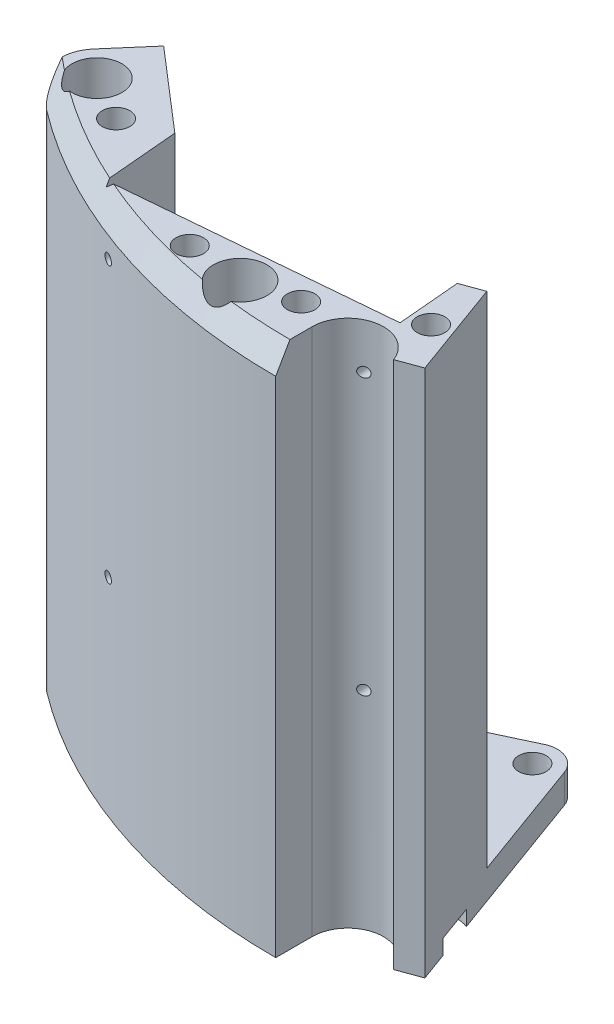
ISO-10303-21;
HEADER;
FILE_DESCRIPTION(('STEP AP214'),'2;1');
FILE_NAME('part.step','',(''),(''),'','','');
FILE_SCHEMA(('AUTOMOTIVE_DESIGN { 1 0 10303 214 1 1 1 1 }'));
ENDSEC;
DATA;
#1=APPLICATION_CONTEXT('core data for automotive mechanical design processes');
#2=APPLICATION_PROTOCOL_DEFINITION('international standard','automotive_design',2000,#1);
#3=PRODUCT_CONTEXT('',#1,'mechanical');
#4=PRODUCT('Part','Part','',(#3));
#5=PRODUCT_RELATED_PRODUCT_CATEGORY('part','',(#4));
#6=PRODUCT_DEFINITION_FORMATION('','',#4);
#7=PRODUCT_DEFINITION_CONTEXT('part definition',#1,'design');
#8=PRODUCT_DEFINITION('design','',#6,#7);
#9=PRODUCT_DEFINITION_SHAPE('','',#8);
#10=(LENGTH_UNIT() NAMED_UNIT(*) SI_UNIT(.MILLI.,.METRE.));
#11=(NAMED_UNIT(*) PLANE_ANGLE_UNIT() SI_UNIT($,.RADIAN.));
#12=(NAMED_UNIT(*) SI_UNIT($,.STERADIAN.) SOLID_ANGLE_UNIT());
#13=UNCERTAINTY_MEASURE_WITH_UNIT(LENGTH_MEASURE(1.E-05),#10,'distance_accuracy_value','');
#14=(GEOMETRIC_REPRESENTATION_CONTEXT(3) GLOBAL_UNCERTAINTY_ASSIGNED_CONTEXT((#13)) GLOBAL_UNIT_ASSIGNED_CONTEXT((#10,
#11,#12)) REPRESENTATION_CONTEXT('',''));
#15=CARTESIAN_POINT('',(0.,0.,0.));
#16=DIRECTION('',(0.,0.,1.));
#17=DIRECTION('',(1.,0.,0.));
#18=AXIS2_PLACEMENT_3D('',#15,#16,#17);
#19=CARTESIAN_POINT('',(6.36054956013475,0.,95.1137624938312));
#20=DIRECTION('',(0.,1.,0.));
#21=DIRECTION('',(0.,0.,1.));
#22=AXIS2_PLACEMENT_3D('',#19,#20,#21);
#23=PLANE('',#22);
#24=CARTESIAN_POINT('',(-49.4892724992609,0.,80.5008951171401));
#25=DIRECTION('',(0.,-1.,0.));
#26=DIRECTION('',(0.,0.,-1.));
#27=AXIS2_PLACEMENT_3D('',#24,#25,#26);
#28=CIRCLE('',#27,4.7625);
#29=CARTESIAN_POINT('',(-49.4892724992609,0.,75.7383951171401));
#30=VERTEX_POINT('',#29);
#31=EDGE_CURVE('E1019',#30,#30,#28,.T.);
#32=ORIENTED_EDGE('',*,*,#31,.F.);
#33=EDGE_LOOP('',(#32));
#34=FACE_BOUND('',#33,.T.);
#35=CARTESIAN_POINT('',(-4.81649345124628,0.,92.2453358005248));
#36=DIRECTION('',(0.,-1.,0.));
#37=DIRECTION('',(0.,0.,-1.));
#38=AXIS2_PLACEMENT_3D('',#35,#36,#37);
#39=CIRCLE('',#38,4.7625);
#40=CARTESIAN_POINT('',(-4.81649345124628,0.,87.4828358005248));
#41=VERTEX_POINT('',#40);
#42=EDGE_CURVE('E657',#41,#41,#39,.T.);
#43=ORIENTED_EDGE('',*,*,#42,.F.);
#44=EDGE_LOOP('',(#43));
#45=FACE_BOUND('',#44,.T.);
#46=CARTESIAN_POINT('',(-23.3566896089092,0.,93.5230346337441));
#47=DIRECTION('',(0.,-1.,0.));
#48=DIRECTION('',(0.,0.,-1.));
#49=AXIS2_PLACEMENT_3D('',#46,#47,#48);
#50=CIRCLE('',#49,4.7625);
#51=CARTESIAN_POINT('',(-23.3566896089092,0.,88.7605346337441));
#52=VERTEX_POINT('',#51);
#53=EDGE_CURVE('E681',#52,#52,#50,.T.);
#54=ORIENTED_EDGE('',*,*,#53,.F.);
#55=EDGE_LOOP('',(#54));
#56=FACE_BOUND('',#55,.T.);
#57=CARTESIAN_POINT('',(-13.5537068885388,0.,94.3577311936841));
#58=DIRECTION('',(0.,1.,0.));
#59=DIRECTION('',(0.,0.,1.));
#60=AXIS2_PLACEMENT_3D('',#57,#58,#59);
#61=CIRCLE('',#60,2.45744999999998);
#62=CARTESIAN_POINT('',(-13.5537068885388,0.,96.8151811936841));
#63=VERTEX_POINT('',#62);
#64=EDGE_CURVE('E538',#63,#63,#61,.T.);
#65=ORIENTED_EDGE('',*,*,#64,.T.);
#66=EDGE_LOOP('',(#65));
#67=FACE_BOUND('',#66,.T.);
#68=CARTESIAN_POINT('',(-39.432126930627,0.,52.157230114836));
#69=DIRECTION('',(0.,1.,0.));
#70=DIRECTION('',(0.,0.,1.));
#71=AXIS2_PLACEMENT_3D('',#68,#69,#70);
#72=CIRCLE('',#71,2.45744999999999);
#73=CARTESIAN_POINT('',(-39.432126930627,0.,54.6146801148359));
#74=VERTEX_POINT('',#73);
#75=EDGE_CURVE('E522',#74,#74,#72,.T.);
#76=ORIENTED_EDGE('',*,*,#75,.T.);
#77=EDGE_LOOP('',(#76));
#78=FACE_BOUND('',#77,.T.);
#79=CARTESIAN_POINT('',(-57.4254275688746,0.,75.9682602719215));
#80=DIRECTION('',(0.,1.,0.));
#81=DIRECTION('',(0.,0.,1.));
#82=AXIS2_PLACEMENT_3D('',#79,#80,#81);
#83=CIRCLE('',#82,2.45744999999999);
#84=CARTESIAN_POINT('',(-57.4254275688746,0.,78.4257102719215));
#85=VERTEX_POINT('',#84);
#86=EDGE_CURVE('E514',#85,#85,#83,.T.);
#87=ORIENTED_EDGE('',*,*,#86,.T.);
#88=EDGE_LOOP('',(#87));
#89=FACE_BOUND('',#88,.T.);
#90=CARTESIAN_POINT('',(-1.98222930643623,0.,53.9385890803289));
#91=DIRECTION('',(0.,1.,0.));
#92=DIRECTION('',(0.,0.,1.));
#93=AXIS2_PLACEMENT_3D('',#90,#91,#92);
#94=CIRCLE('',#93,2.45744999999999);
#95=CARTESIAN_POINT('',(-1.98222930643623,0.,56.3960390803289));
#96=VERTEX_POINT('',#95);
#97=EDGE_CURVE('E507',#96,#96,#94,.T.);
#98=ORIENTED_EDGE('',*,*,#97,.T.);
#99=EDGE_LOOP('',(#98));
#100=FACE_BOUND('',#99,.T.);
#101=CARTESIAN_POINT('',(-7.20072306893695,0.,71.4574975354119));
#102=DIRECTION('',(0.,1.,0.));
#103=DIRECTION('',(0.,0.,1.));
#104=AXIS2_PLACEMENT_3D('',#101,#102,#103);
#105=CIRCLE('',#104,1.35254999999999);
#106=CARTESIAN_POINT('',(-7.20072306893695,0.,72.8100475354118));
#107=VERTEX_POINT('',#106);
#108=EDGE_CURVE('E499',#107,#107,#105,.T.);
#109=ORIENTED_EDGE('',*,*,#108,.T.);
#110=EDGE_LOOP('',(#109));
#111=FACE_BOUND('',#110,.T.);
#112=CARTESIAN_POINT('',(-37.3356126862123,0.,74.0939587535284));
#113=DIRECTION('',(0.,1.,0.));
#114=DIRECTION('',(0.,0.,1.));
#115=AXIS2_PLACEMENT_3D('',#112,#113,#114);
#116=CIRCLE('',#115,1.35254999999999);
#117=CARTESIAN_POINT('',(-37.3356126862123,0.,75.4465087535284));
#118=VERTEX_POINT('',#117);
#119=EDGE_CURVE('E492',#118,#118,#116,.T.);
#120=ORIENTED_EDGE('',*,*,#119,.T.);
#121=EDGE_LOOP('',(#120));
#122=FACE_BOUND('',#121,.T.);
#123=CARTESIAN_POINT('',(10.2756616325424,0.,84.2327734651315));
#124=DIRECTION('',(0.,-1.,0.));
#125=DIRECTION('',(0.,0.,-1.));
#126=AXIS2_PLACEMENT_3D('',#123,#124,#125);
#127=CIRCLE('',#126,4.7625);
#128=CARTESIAN_POINT('',(14.543488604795,0.,86.3463153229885));
#129=VERTEX_POINT('',#128);
#130=CARTESIAN_POINT('',(12.1864482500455,0.,79.8704001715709));
#131=VERTEX_POINT('',#130);
#132=EDGE_CURVE('E236',#129,#131,#127,.T.);
#133=ORIENTED_EDGE('',*,*,#132,.F.);
#134=DIRECTION('',(-0.342020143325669,0.,-0.939692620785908));
#135=VECTOR('',#134,1.);
#136=CARTESIAN_POINT('',(2.19470439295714,0.,52.4183095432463));
#137=LINE('',#136,#135);
#138=CARTESIAN_POINT('',(16.404069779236,0.,91.4582200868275));
#139=VERTEX_POINT('',#138);
#140=EDGE_CURVE('E256',#139,#129,#137,.T.);
#141=ORIENTED_EDGE('',*,*,#140,.F.);
#142=DIRECTION('',(0.939692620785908,0.,-0.34202014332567));
#143=VECTOR('',#142,1.);
#144=CARTESIAN_POINT('',(12.3275977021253,0.,92.9419345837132));
#145=LINE('',#144,#143);
#146=CARTESIAN_POINT('',(12.3275977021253,0.,92.9419345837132));
#147=VERTEX_POINT('',#146);
#148=EDGE_CURVE('E257',#147,#139,#145,.T.);
#149=ORIENTED_EDGE('',*,*,#148,.F.);
#150=CARTESIAN_POINT('',(6.36054956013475,0.,95.1137624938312));
#151=DIRECTION('',(0.,-1.,0.));
#152=DIRECTION('',(0.,0.,1.));
#153=AXIS2_PLACEMENT_3D('',#150,#151,#152);
#154=CIRCLE('',#153,6.34999999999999);
#155=CARTESIAN_POINT('',(0.0105495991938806,0.,95.1144668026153));
#156=VERTEX_POINT('',#155);
#157=EDGE_CURVE('E262',#156,#147,#154,.T.);
#158=ORIENTED_EDGE('',*,*,#157,.F.);
#159=DIRECTION('',(-0.000110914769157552,0.,-0.999999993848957));
#160=VECTOR('',#159,1.);
#161=CARTESIAN_POINT('',(0.0112689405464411,0.,101.599999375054));
#162=LINE('',#161,#160);
#163=CARTESIAN_POINT('',(0.0112689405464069,0.,101.599999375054));
#164=VERTEX_POINT('',#163);
#165=EDGE_CURVE('E291',#164,#156,#162,.T.);
#166=ORIENTED_EDGE('',*,*,#165,.F.);
#167=CARTESIAN_POINT('',(0.,0.,0.));
#168=DIRECTION('',(0.,1.,0.));
#169=DIRECTION('',(0.,0.,1.));
#170=AXIS2_PLACEMENT_3D('',#167,#168,#169);
#171=CIRCLE('',#170,101.6);
#172=CARTESIAN_POINT('',(-61.2663045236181,0.,81.0493672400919));
#173=VERTEX_POINT('',#172);
#174=EDGE_CURVE('E287',#173,#164,#171,.T.);
#175=ORIENTED_EDGE('',*,*,#174,.F.);
#176=CARTESIAN_POINT('',(-57.4254275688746,0.,75.9682602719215));
#177=DIRECTION('',(0.,1.,0.));
#178=DIRECTION('',(0.,0.,-1.));
#179=AXIS2_PLACEMENT_3D('',#176,#177,#178);
#180=CIRCLE('',#179,6.36945710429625);
#181=CARTESIAN_POINT('',(-62.2489361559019,0.,71.8084827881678));
#182=VERTEX_POINT('',#181);
#183=EDGE_CURVE('E283',#182,#173,#180,.T.);
#184=ORIENTED_EDGE('',*,*,#183,.F.);
#185=DIRECTION('',(-0.653081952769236,0.,0.757287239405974));
#186=VECTOR('',#185,1.);
#187=CARTESIAN_POINT('',(-62.2489361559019,0.,71.8084827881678));
#188=LINE('',#187,#186);
#189=CARTESIAN_POINT('',(-42.7982687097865,0.,49.2542808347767));
#190=VERTEX_POINT('',#189);
#191=EDGE_CURVE('E280',#190,#182,#188,.T.);
#192=ORIENTED_EDGE('',*,*,#191,.F.);
#193=CARTESIAN_POINT('',(-39.432126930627,0.,52.157230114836));
#194=DIRECTION('',(0.,1.,0.));
#195=DIRECTION('',(0.,0.,1.));
#196=AXIS2_PLACEMENT_3D('',#193,#194,#195);
#197=CIRCLE('',#196,4.445);
#198=CARTESIAN_POINT('',(-36.0909135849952,0.,49.225623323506));
#199=VERTEX_POINT('',#198);
#200=EDGE_CURVE('E277',#199,#190,#197,.T.);
#201=ORIENTED_EDGE('',*,*,#200,.F.);
#202=DIRECTION('',(-0.659529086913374,0.,-0.751679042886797));
#203=VECTOR('',#202,1.);
#204=CARTESIAN_POINT('',(-36.0909135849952,0.,49.225623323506));
#205=LINE('',#204,#203);
#206=CARTESIAN_POINT('',(-29.4138285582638,0.,56.8356362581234));
#207=VERTEX_POINT('',#206);
#208=EDGE_CURVE('E274',#207,#199,#205,.T.);
#209=ORIENTED_EDGE('',*,*,#208,.F.);
#210=CARTESIAN_POINT('',(-24.6406666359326,0.,52.6476265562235));
#211=DIRECTION('',(0.,-1.,0.));
#212=DIRECTION('',(0.,0.,1.));
#213=AXIS2_PLACEMENT_3D('',#210,#211,#212);
#214=CIRCLE('',#213,6.35);
#215=CARTESIAN_POINT('',(-21.9428975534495,0.,58.3960647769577));
#216=VERTEX_POINT('',#215);
#217=EDGE_CURVE('E271',#216,#207,#214,.T.);
#218=ORIENTED_EDGE('',*,*,#217,.F.);
#219=DIRECTION('',(-0.90526586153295,0.,0.424845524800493));
#220=VECTOR('',#219,1.);
#221=CARTESIAN_POINT('',(-21.9428975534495,0.,58.3960647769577));
#222=LINE('',#221,#220);
#223=CARTESIAN_POINT('',(-3.87066766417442,0.,49.9146823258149));
#224=VERTEX_POINT('',#223);
#225=EDGE_CURVE('E268',#224,#216,#222,.T.);
#226=ORIENTED_EDGE('',*,*,#225,.F.);
#227=CARTESIAN_POINT('',(-1.98222930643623,0.,53.9385890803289));
#228=DIRECTION('',(0.,1.,0.));
#229=DIRECTION('',(0.,0.,-1.));
#230=AXIS2_PLACEMENT_3D('',#227,#228,#229);
#231=CIRCLE('',#230,4.445);
#232=CARTESIAN_POINT('',(2.19470439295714,0.,52.4183095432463));
#233=VERTEX_POINT('',#232);
#234=EDGE_CURVE('E254',#233,#224,#231,.T.);
#235=ORIENTED_EDGE('',*,*,#234,.F.);
#236=EDGE_CURVE('E250',#131,#233,#137,.T.);
#237=ORIENTED_EDGE('',*,*,#236,.F.);
#238=EDGE_LOOP('',(#133,#141,#149,#158,#166,#175,#184,#192,#201,#209,#218,#226,#235,#237));
#239=FACE_BOUND('',#238,.T.);
#240=ADVANCED_FACE('F46',(#34,#45,#56,#67,#78,#89,#100,#111,#122,#239),#23,.F.);
#241=CARTESIAN_POINT('',(-57.4254275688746,5.08,75.9682602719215));
#242=DIRECTION('',(0.,-1.,0.));
#243=DIRECTION('',(0.,0.,-1.));
#244=AXIS2_PLACEMENT_3D('',#241,#242,#243);
#245=CYLINDRICAL_SURFACE('',#244,6.36945710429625);
#246=CARTESIAN_POINT('',(-63.7922558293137,93.9802000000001,75.7852802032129));
#247=CARTESIAN_POINT('',(-63.7950176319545,93.8494053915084,75.8816601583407));
#248=CARTESIAN_POINT('',(-63.7956378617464,93.7193923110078,75.9791837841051));
#249=CARTESIAN_POINT('',(-63.7922444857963,93.4611691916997,76.176592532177));
#250=CARTESIAN_POINT('',(-63.788229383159,93.3329597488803,76.2764784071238));
#251=CARTESIAN_POINT('',(-63.7751705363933,93.0778506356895,76.4792739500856));
#252=CARTESIAN_POINT('',(-63.7660946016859,92.9509647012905,76.5821989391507));
#253=CARTESIAN_POINT('',(-63.7424626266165,92.6997424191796,76.7904667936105));
#254=CARTESIAN_POINT('',(-63.7279070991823,92.5754058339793,76.89580943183));
#255=CARTESIAN_POINT('',(-63.6745994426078,92.201811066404,77.219868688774));
#256=CARTESIAN_POINT('',(-63.6264286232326,91.9571722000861,77.4425118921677));
#257=CARTESIAN_POINT('',(-63.5003076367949,91.485864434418,77.897342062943));
#258=CARTESIAN_POINT('',(-63.4224453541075,91.2591448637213,78.1294990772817));
#259=CARTESIAN_POINT('',(-63.2896451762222,90.9634316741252,78.4563178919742));
#260=CARTESIAN_POINT('',(-63.2502091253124,90.8834389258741,78.5474246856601));
#261=CARTESIAN_POINT('',(-63.1655512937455,90.7278559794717,78.7307155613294));
#262=CARTESIAN_POINT('',(-63.1203291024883,90.6522660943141,78.8228997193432));
#263=CARTESIAN_POINT('',(-62.9755649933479,90.4335351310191,79.1002635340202));
#264=CARTESIAN_POINT('',(-62.8667204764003,90.2979570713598,79.2867739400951));
#265=CARTESIAN_POINT('',(-62.6188316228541,90.0527945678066,79.6628172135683));
#266=CARTESIAN_POINT('',(-62.4793615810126,89.9436274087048,79.8523537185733));
#267=CARTESIAN_POINT('',(-62.2476135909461,89.8089983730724,80.1313272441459));
#268=CARTESIAN_POINT('',(-62.1667089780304,89.7690038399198,80.2233310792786));
#269=CARTESIAN_POINT('',(-61.9975684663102,89.6998069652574,80.4045702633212));
#270=CARTESIAN_POINT('',(-61.9093380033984,89.6705967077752,80.4938075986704));
#271=CARTESIAN_POINT('',(-61.7313860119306,89.6253543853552,80.6632443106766));
#272=CARTESIAN_POINT('',(-61.6420479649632,89.6086560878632,80.7436676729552));
#273=CARTESIAN_POINT('',(-61.4579149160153,89.586221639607,80.900177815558));
#274=CARTESIAN_POINT('',(-61.3631053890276,89.5805161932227,80.9762518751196));
#275=CARTESIAN_POINT('',(-61.2661045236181,89.5805898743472,81.0495184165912));
#276=B_SPLINE_CURVE_WITH_KNOTS('',3,(#246,#247,#248,#249,#250,#251,#252,#253,#254,#255,#256,
#257,#258,#259,#260,#261,#262,#263,#264,#265,#266,#267,#268,#269,#270,#271,#272,#273,#274,#275),
.UNSPECIFIED.,.F.,.F.,(4,2,2,2,2,2,2,2,2,2,2,2,2,2,4),(0.,0.487476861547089,0.975111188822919,
1.46588320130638,1.95660928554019,2.95789348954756,3.95623669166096,4.33853559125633,
4.72086163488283,5.48332778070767,6.25715163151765,6.64321070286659,7.02898582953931,
7.39237966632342,7.75678704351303),.UNSPECIFIED.);
#277=CARTESIAN_POINT('',(-63.7922600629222,93.98,75.7854275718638));
#278=VERTEX_POINT('',#277);
#279=CARTESIAN_POINT('',(-61.2663041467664,89.5805909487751,81.0493667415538));
#280=VERTEX_POINT('',#279);
#281=EDGE_CURVE('E769',#278,#280,#276,.T.);
#282=ORIENTED_EDGE('',*,*,#281,.F.);
#283=CARTESIAN_POINT('',(-57.4254275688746,93.98,75.9682602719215));
#284=DIRECTION('',(0.,1.,0.));
#285=DIRECTION('',(0.,0.,1.));
#286=AXIS2_PLACEMENT_3D('',#283,#284,#285);
#287=CIRCLE('',#286,6.36945710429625);
#288=CARTESIAN_POINT('',(-62.2489361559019,93.98,71.8084827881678));
#289=VERTEX_POINT('',#288);
#290=EDGE_CURVE('E727',#289,#278,#287,.T.);
#291=ORIENTED_EDGE('',*,*,#290,.F.);
#292=DIRECTION('',(0.,-1.,0.));
#293=VECTOR('',#292,1.);
#294=CARTESIAN_POINT('',(-62.2489361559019,5.08,71.8084827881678));
#295=LINE('',#294,#293);
#296=EDGE_CURVE('E306',#289,#182,#295,.T.);
#297=ORIENTED_EDGE('',*,*,#296,.T.);
#298=ORIENTED_EDGE('',*,*,#183,.T.);
#299=DIRECTION('',(0.,-1.,0.));
#300=VECTOR('',#299,1.);
#301=CARTESIAN_POINT('',(-61.2663045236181,5.08,81.0493672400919));
#302=LINE('',#301,#300);
#303=EDGE_CURVE('E303',#280,#173,#302,.T.);
#304=ORIENTED_EDGE('',*,*,#303,.F.);
#305=EDGE_LOOP('',(#282,#291,#297,#298,#304));
#306=FACE_BOUND('',#305,.T.);
#307=ADVANCED_FACE('F724',(#306),#245,.T.);
#308=CARTESIAN_POINT('',(0.,5.08,0.));
#309=DIRECTION('',(0.,-1.,0.));
#310=DIRECTION('',(0.,0.,-1.));
#311=AXIS2_PLACEMENT_3D('',#308,#309,#310);
#312=CYLINDRICAL_SURFACE('',#311,101.6);
#313=CARTESIAN_POINT('',(-37.5427409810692,85.9,94.409229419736));
#314=CARTESIAN_POINT('',(-37.5427381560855,85.9460595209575,94.4092305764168));
#315=CARTESIAN_POINT('',(-37.5389981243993,85.9921613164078,94.4107180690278));
#316=CARTESIAN_POINT('',(-37.5242023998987,86.0830235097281,94.4165996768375));
#317=CARTESIAN_POINT('',(-37.5131359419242,86.1277818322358,94.4209980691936));
#318=CARTESIAN_POINT('',(-37.4842309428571,86.2145406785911,94.4324767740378));
#319=CARTESIAN_POINT('',(-37.4664113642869,86.2565485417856,94.4395495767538));
#320=CARTESIAN_POINT('',(-37.4247367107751,86.3369164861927,94.4560722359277));
#321=CARTESIAN_POINT('',(-37.4008822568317,86.3752769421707,94.4655218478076));
#322=CARTESIAN_POINT('',(-37.346841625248,86.4491688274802,94.486900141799));
#323=CARTESIAN_POINT('',(-37.3164261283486,86.4845060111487,94.4989184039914));
#324=CARTESIAN_POINT('',(-37.2509508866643,86.5498034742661,94.5247475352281));
#325=CARTESIAN_POINT('',(-37.215889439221,86.5797617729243,94.5385590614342));
#326=CARTESIAN_POINT('',(-37.1383578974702,86.6366490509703,94.5690450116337));
#327=CARTESIAN_POINT('',(-37.0954971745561,86.6629659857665,94.5858677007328));
#328=CARTESIAN_POINT('',(-37.0065282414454,86.7082985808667,94.620712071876));
#329=CARTESIAN_POINT('',(-36.9604185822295,86.727310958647,94.638734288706));
#330=CARTESIAN_POINT('',(-36.861402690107,86.759365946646,94.6773472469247));
#331=CARTESIAN_POINT('',(-36.8082750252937,86.7716332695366,94.6980158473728));
#332=CARTESIAN_POINT('',(-36.7008392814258,86.7870161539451,94.7397050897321));
#333=CARTESIAN_POINT('',(-36.6465307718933,86.7901283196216,94.7607258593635));
#334=CARTESIAN_POINT('',(-36.534901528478,86.7870607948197,94.8038224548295));
#335=CARTESIAN_POINT('',(-36.4775909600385,86.7803253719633,94.8258878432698));
#336=CARTESIAN_POINT('',(-36.3648019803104,86.7565597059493,94.8691985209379));
#337=CARTESIAN_POINT('',(-36.309323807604,86.7395281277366,94.8904437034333));
#338=CARTESIAN_POINT('',(-36.2024400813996,86.6955264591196,94.9312729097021));
#339=CARTESIAN_POINT('',(-36.1510020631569,86.6686482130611,94.9508702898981));
#340=CARTESIAN_POINT('',(-36.0535172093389,86.6053059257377,94.9879287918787));
#341=CARTESIAN_POINT('',(-36.0074680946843,86.5688459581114,95.005390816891));
#342=CARTESIAN_POINT('',(-35.9259960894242,86.4902127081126,95.0362276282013));
#343=CARTESIAN_POINT('',(-35.8900313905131,86.4486848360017,95.0498122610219));
#344=CARTESIAN_POINT('',(-35.8260694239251,86.3591132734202,95.0739392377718));
#345=CARTESIAN_POINT('',(-35.7980655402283,86.3110750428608,95.0844841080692));
#346=CARTESIAN_POINT('',(-35.7539922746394,86.2153855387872,95.101064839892));
#347=CARTESIAN_POINT('',(-35.736971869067,86.1682340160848,95.1074604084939));
#348=CARTESIAN_POINT('',(-35.7113292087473,86.0713959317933,95.1170918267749));
#349=CARTESIAN_POINT('',(-35.7027018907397,86.0217109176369,95.1203295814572));
#350=CARTESIAN_POINT('',(-35.6946367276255,85.9255936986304,95.1233563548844));
#351=CARTESIAN_POINT('',(-35.6945073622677,85.8792263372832,95.1234048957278));
#352=CARTESIAN_POINT('',(-35.7017096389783,85.7871640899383,95.1207019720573));
#353=CARTESIAN_POINT('',(-35.7090399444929,85.741469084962,95.1179510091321));
#354=CARTESIAN_POINT('',(-35.7306011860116,85.6529974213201,95.1098536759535));
#355=CARTESIAN_POINT('',(-35.7446867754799,85.6101800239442,95.104561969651));
#356=CARTESIAN_POINT('',(-35.7791176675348,85.527532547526,95.0916141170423));
#357=CARTESIAN_POINT('',(-35.799463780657,85.4877028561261,95.0839576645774));
#358=CARTESIAN_POINT('',(-35.8466502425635,85.4102997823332,95.0661786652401));
#359=CARTESIAN_POINT('',(-35.8737285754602,85.3728927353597,95.0559656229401));
#360=CARTESIAN_POINT('',(-35.9329401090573,85.3029926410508,95.0335983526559));
#361=CARTESIAN_POINT('',(-35.9650749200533,85.2705011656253,95.0214435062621));
#362=CARTESIAN_POINT('',(-36.0363605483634,85.2083933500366,94.9944329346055));
#363=CARTESIAN_POINT('',(-36.0758757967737,85.1792574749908,94.9794353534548));
#364=CARTESIAN_POINT('',(-36.1585626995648,85.1277545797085,94.9479873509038));
#365=CARTESIAN_POINT('',(-36.2017358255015,85.1053903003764,94.931536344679));
#366=CARTESIAN_POINT('',(-36.2950202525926,85.0657979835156,94.8959126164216));
#367=CARTESIAN_POINT('',(-36.3453964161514,85.0492908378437,94.8766313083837));
#368=CARTESIAN_POINT('',(-36.4478997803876,85.0248475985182,94.837300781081));
#369=CARTESIAN_POINT('',(-36.500027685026,85.0169149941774,94.8172512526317));
#370=CARTESIAN_POINT('',(-36.6087739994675,85.009388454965,94.7753201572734));
#371=CARTESIAN_POINT('',(-36.6654317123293,85.0104765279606,94.7534154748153));
#372=CARTESIAN_POINT('',(-36.7777887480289,85.02260362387,94.7098616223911));
#373=CARTESIAN_POINT('',(-36.8334878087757,85.0336453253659,94.6882125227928));
#374=CARTESIAN_POINT('',(-36.9434721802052,85.0658963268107,94.6453560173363));
#375=CARTESIAN_POINT('',(-36.9977056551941,85.087307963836,94.6241665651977));
#376=CARTESIAN_POINT('',(-37.1017632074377,85.1401273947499,94.5834144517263));
#377=CARTESIAN_POINT('',(-37.1515881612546,85.1715331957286,94.5638514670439));
#378=CARTESIAN_POINT('',(-37.2424139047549,85.2419070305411,94.5281167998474));
#379=CARTESIAN_POINT('',(-37.2837419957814,85.2803873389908,94.5118204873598));
#380=CARTESIAN_POINT('',(-37.3589053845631,85.3650629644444,94.4821349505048));
#381=CARTESIAN_POINT('',(-37.3927443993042,85.4112544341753,94.4687442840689));
#382=CARTESIAN_POINT('',(-37.4480380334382,85.5047735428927,94.4468381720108));
#383=CARTESIAN_POINT('',(-37.470423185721,85.5514659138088,94.4379571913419));
#384=CARTESIAN_POINT('',(-37.5065808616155,85.6484997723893,94.4236028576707));
#385=CARTESIAN_POINT('',(-37.5203746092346,85.6988319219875,94.4181211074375));
#386=CARTESIAN_POINT('',(-37.5338939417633,85.7747612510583,94.4127471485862));
#387=CARTESIAN_POINT('',(-37.537205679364,85.7996705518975,94.4114304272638));
#388=CARTESIAN_POINT('',(-37.5416299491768,85.8497157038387,94.4096712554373));
#389=CARTESIAN_POINT('',(-37.5427425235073,85.8748515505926,94.4092287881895));
#390=CARTESIAN_POINT('',(-37.5427409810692,85.9,94.409229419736));
#391=B_SPLINE_CURVE_WITH_KNOTS('',3,(#313,#314,#315,#316,#317,#318,#319,#320,#321,#322,#323,
#324,#325,#326,#327,#328,#329,#330,#331,#332,#333,#334,#335,#336,#337,#338,#339,#340,#341,#342,
#343,#344,#345,#346,#347,#348,#349,#350,#351,#352,#353,#354,#355,#356,#357,#358,#359,#360,#361,
#362,#363,#364,#365,#366,#367,#368,#369,#370,#371,#372,#373,#374,#375,#376,#377,#378,#379,#380,
#381,#382,#383,#384,#385,#386,#387,#388,#389,#390),.UNSPECIFIED.,.T.,.F.,(4,2,2,2,2,2,2,2,2,2,2,
2,2,2,2,2,2,2,2,2,2,2,2,2,2,2,2,2,2,2,2,2,2,2,2,2,2,2,4),(0.,0.138079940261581,
0.276363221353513,0.414261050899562,0.552144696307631,0.695994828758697,0.839897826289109,
0.998342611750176,1.15685851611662,1.33103393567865,1.50527395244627,1.68973422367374,
1.87421841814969,2.05702392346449,2.23975183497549,2.40858259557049,2.57727263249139,
2.72806413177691,2.878764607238,3.01718525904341,3.15558111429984,3.291124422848,
3.42668528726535,3.56797137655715,3.70930255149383,3.86266920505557,4.0160978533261,
4.18460685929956,4.35318441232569,4.53461712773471,4.71609868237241,4.90127336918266,
5.08641115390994,5.26175860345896,5.43701882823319,5.59376850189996,5.75012939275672,
5.82552233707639,5.90091383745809),.UNSPECIFIED.);
#392=CARTESIAN_POINT('',(-37.5427409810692,85.9,94.409229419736));
#393=VERTEX_POINT('',#392);
#394=EDGE_CURVE('E337',#393,#393,#391,.T.);
#395=ORIENTED_EDGE('',*,*,#394,.T.);
#396=EDGE_LOOP('',(#395));
#397=FACE_BOUND('',#396,.T.);
#398=CARTESIAN_POINT('',(-37.5427409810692,36.9,94.409229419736));
#399=CARTESIAN_POINT('',(-37.5427381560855,36.9460595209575,94.4092305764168));
#400=CARTESIAN_POINT('',(-37.5389981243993,36.9921613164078,94.4107180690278));
#401=CARTESIAN_POINT('',(-37.5242023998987,37.0830235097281,94.4165996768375));
#402=CARTESIAN_POINT('',(-37.5131359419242,37.1277818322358,94.4209980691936));
#403=CARTESIAN_POINT('',(-37.4842309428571,37.214540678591,94.4324767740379));
#404=CARTESIAN_POINT('',(-37.4664113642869,37.2565485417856,94.4395495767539));
#405=CARTESIAN_POINT('',(-37.4247367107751,37.3369164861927,94.4560722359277));
#406=CARTESIAN_POINT('',(-37.4008822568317,37.3752769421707,94.4655218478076));
#407=CARTESIAN_POINT('',(-37.346841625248,37.4491688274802,94.486900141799));
#408=CARTESIAN_POINT('',(-37.3164261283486,37.4845060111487,94.4989184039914));
#409=CARTESIAN_POINT('',(-37.2509508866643,37.549803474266,94.5247475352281));
#410=CARTESIAN_POINT('',(-37.2158894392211,37.5797617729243,94.5385590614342));
#411=CARTESIAN_POINT('',(-37.1383578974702,37.6366490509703,94.5690450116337));
#412=CARTESIAN_POINT('',(-37.0954971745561,37.6629659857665,94.5858677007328));
#413=CARTESIAN_POINT('',(-37.0065282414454,37.7082985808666,94.620712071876));
#414=CARTESIAN_POINT('',(-36.9604185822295,37.727310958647,94.638734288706));
#415=CARTESIAN_POINT('',(-36.861402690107,37.759365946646,94.6773472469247));
#416=CARTESIAN_POINT('',(-36.8082750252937,37.7716332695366,94.6980158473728));
#417=CARTESIAN_POINT('',(-36.7008392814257,37.7870161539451,94.7397050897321));
#418=CARTESIAN_POINT('',(-36.6465307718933,37.7901283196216,94.7607258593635));
#419=CARTESIAN_POINT('',(-36.534901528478,37.7870607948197,94.8038224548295));
#420=CARTESIAN_POINT('',(-36.4775909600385,37.7803253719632,94.8258878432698));
#421=CARTESIAN_POINT('',(-36.3648019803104,37.7565597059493,94.8691985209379));
#422=CARTESIAN_POINT('',(-36.309323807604,37.7395281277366,94.8904437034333));
#423=CARTESIAN_POINT('',(-36.2024400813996,37.6955264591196,94.9312729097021));
#424=CARTESIAN_POINT('',(-36.1510020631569,37.6686482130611,94.9508702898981));
#425=CARTESIAN_POINT('',(-36.0535172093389,37.6053059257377,94.9879287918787));
#426=CARTESIAN_POINT('',(-36.0074680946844,37.5688459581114,95.005390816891));
#427=CARTESIAN_POINT('',(-35.9259960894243,37.4902127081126,95.0362276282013));
#428=CARTESIAN_POINT('',(-35.8900313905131,37.4486848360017,95.0498122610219));
#429=CARTESIAN_POINT('',(-35.8260694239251,37.3591132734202,95.0739392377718));
#430=CARTESIAN_POINT('',(-35.7980655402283,37.3110750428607,95.0844841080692));
#431=CARTESIAN_POINT('',(-35.7539922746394,37.2153855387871,95.101064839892));
#432=CARTESIAN_POINT('',(-35.736971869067,37.1682340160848,95.1074604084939));
#433=CARTESIAN_POINT('',(-35.7113292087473,37.0713959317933,95.1170918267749));
#434=CARTESIAN_POINT('',(-35.7027018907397,37.0217109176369,95.1203295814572));
#435=CARTESIAN_POINT('',(-35.6946367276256,36.9255936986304,95.1233563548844));
#436=CARTESIAN_POINT('',(-35.6945073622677,36.8792263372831,95.1234048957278));
#437=CARTESIAN_POINT('',(-35.7017096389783,36.7871640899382,95.1207019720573));
#438=CARTESIAN_POINT('',(-35.7090399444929,36.741469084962,95.1179510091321));
#439=CARTESIAN_POINT('',(-35.7306011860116,36.6529974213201,95.1098536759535));
#440=CARTESIAN_POINT('',(-35.7446867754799,36.6101800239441,95.1045619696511));
#441=CARTESIAN_POINT('',(-35.7791176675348,36.5275325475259,95.0916141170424));
#442=CARTESIAN_POINT('',(-35.799463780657,36.487702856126,95.0839576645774));
#443=CARTESIAN_POINT('',(-35.8466502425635,36.4102997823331,95.0661786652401));
#444=CARTESIAN_POINT('',(-35.8737285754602,36.3728927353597,95.0559656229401));
#445=CARTESIAN_POINT('',(-35.9329401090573,36.3029926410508,95.0335983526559));
#446=CARTESIAN_POINT('',(-35.9650749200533,36.2705011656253,95.0214435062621));
#447=CARTESIAN_POINT('',(-36.0363605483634,36.2083933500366,94.9944329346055));
#448=CARTESIAN_POINT('',(-36.0758757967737,36.1792574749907,94.9794353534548));
#449=CARTESIAN_POINT('',(-36.1585626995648,36.1277545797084,94.9479873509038));
#450=CARTESIAN_POINT('',(-36.2017358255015,36.1053903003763,94.931536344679));
#451=CARTESIAN_POINT('',(-36.2950202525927,36.0657979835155,94.8959126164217));
#452=CARTESIAN_POINT('',(-36.3453964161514,36.0492908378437,94.8766313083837));
#453=CARTESIAN_POINT('',(-36.4478997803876,36.0248475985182,94.837300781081));
#454=CARTESIAN_POINT('',(-36.500027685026,36.0169149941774,94.8172512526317));
#455=CARTESIAN_POINT('',(-36.6087739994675,36.009388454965,94.7753201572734));
#456=CARTESIAN_POINT('',(-36.6654317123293,36.0104765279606,94.7534154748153));
#457=CARTESIAN_POINT('',(-36.7777887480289,36.02260362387,94.7098616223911));
#458=CARTESIAN_POINT('',(-36.8334878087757,36.0336453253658,94.6882125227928));
#459=CARTESIAN_POINT('',(-36.9434721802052,36.0658963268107,94.6453560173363));
#460=CARTESIAN_POINT('',(-36.9977056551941,36.087307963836,94.6241665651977));
#461=CARTESIAN_POINT('',(-37.1017632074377,36.1401273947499,94.5834144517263));
#462=CARTESIAN_POINT('',(-37.1515881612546,36.1715331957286,94.5638514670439));
#463=CARTESIAN_POINT('',(-37.2424139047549,36.2419070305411,94.5281167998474));
#464=CARTESIAN_POINT('',(-37.2837419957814,36.2803873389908,94.5118204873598));
#465=CARTESIAN_POINT('',(-37.3589053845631,36.3650629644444,94.4821349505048));
#466=CARTESIAN_POINT('',(-37.3927443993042,36.4112544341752,94.4687442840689));
#467=CARTESIAN_POINT('',(-37.4480380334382,36.5047735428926,94.4468381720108));
#468=CARTESIAN_POINT('',(-37.470423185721,36.5514659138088,94.4379571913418));
#469=CARTESIAN_POINT('',(-37.5065808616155,36.6484997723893,94.4236028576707));
#470=CARTESIAN_POINT('',(-37.5203746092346,36.6988319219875,94.4181211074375));
#471=CARTESIAN_POINT('',(-37.5338939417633,36.7747612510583,94.4127471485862));
#472=CARTESIAN_POINT('',(-37.537205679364,36.7996705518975,94.4114304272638));
#473=CARTESIAN_POINT('',(-37.5416299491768,36.8497157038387,94.4096712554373));
#474=CARTESIAN_POINT('',(-37.5427425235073,36.8748515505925,94.4092287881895));
#475=CARTESIAN_POINT('',(-37.5427409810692,36.9,94.409229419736));
#476=B_SPLINE_CURVE_WITH_KNOTS('',3,(#398,#399,#400,#401,#402,#403,#404,#405,#406,#407,#408,
#409,#410,#411,#412,#413,#414,#415,#416,#417,#418,#419,#420,#421,#422,#423,#424,#425,#426,#427,
#428,#429,#430,#431,#432,#433,#434,#435,#436,#437,#438,#439,#440,#441,#442,#443,#444,#445,#446,
#447,#448,#449,#450,#451,#452,#453,#454,#455,#456,#457,#458,#459,#460,#461,#462,#463,#464,#465,
#466,#467,#468,#469,#470,#471,#472,#473,#474,#475),.UNSPECIFIED.,.T.,.F.,(4,2,2,2,2,2,2,2,2,2,2,
2,2,2,2,2,2,2,2,2,2,2,2,2,2,2,2,2,2,2,2,2,2,2,2,2,2,2,4),(0.,0.138079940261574,
0.276363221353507,0.414261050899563,0.552144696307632,0.695994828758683,0.8398978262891,
0.998342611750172,1.15685851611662,1.33103393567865,1.50527395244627,1.68973422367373,
1.87421841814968,2.05702392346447,2.23975183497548,2.40858259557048,2.57727263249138,
2.7280641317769,2.87876460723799,3.01718525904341,3.15558111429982,3.291124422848,
3.42668528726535,3.56797137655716,3.70930255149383,3.86266920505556,4.01609785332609,
4.18460685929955,4.35318441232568,4.53461712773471,4.71609868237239,4.90127336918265,
5.08641115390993,5.26175860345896,5.43701882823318,5.59376850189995,5.7501293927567,
5.82552233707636,5.90091383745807),.UNSPECIFIED.);
#477=CARTESIAN_POINT('',(-37.5427409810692,36.9,94.409229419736));
#478=VERTEX_POINT('',#477);
#479=EDGE_CURVE('E467',#478,#478,#476,.T.);
#480=ORIENTED_EDGE('',*,*,#479,.T.);
#481=EDGE_LOOP('',(#480));
#482=FACE_BOUND('',#481,.T.);
#483=CARTESIAN_POINT('',(0.,89.5805909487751,0.));
#484=DIRECTION('',(0.,-1.,0.));
#485=DIRECTION('',(0.,0.,-1.));
#486=AXIS2_PLACEMENT_3D('',#483,#484,#485);
#487=CIRCLE('',#486,101.599999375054);
#488=CARTESIAN_POINT('',(0.0112689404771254,89.5805909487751,101.599998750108));
#489=VERTEX_POINT('',#488);
#490=EDGE_CURVE('E703',#489,#280,#487,.T.);
#491=ORIENTED_EDGE('',*,*,#490,.T.);
#492=ORIENTED_EDGE('',*,*,#303,.T.);
#493=ORIENTED_EDGE('',*,*,#174,.T.);
#494=DIRECTION('',(0.,-1.,0.));
#495=VECTOR('',#494,1.);
#496=CARTESIAN_POINT('',(0.0112689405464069,5.08,101.599999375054));
#497=LINE('',#496,#495);
#498=EDGE_CURVE('E299',#489,#164,#497,.T.);
#499=ORIENTED_EDGE('',*,*,#498,.F.);
#500=EDGE_LOOP('',(#491,#492,#493,#499));
#501=FACE_BOUND('',#500,.T.);
#502=ADVANCED_FACE('F352',(#397,#482,#501),#312,.T.);
#503=CARTESIAN_POINT('',(0.0112689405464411,5.08,101.599999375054));
#504=DIRECTION('',(-0.999999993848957,0.,0.000110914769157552));
#505=DIRECTION('',(0.000110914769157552,0.,0.999999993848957));
#506=AXIS2_PLACEMENT_3D('',#503,#504,#505);
#507=PLANE('',#506);
#508=DIRECTION('',(-5.54573845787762E-05,0.866025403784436,-0.499999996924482));
#509=VECTOR('',#508,1.);
#510=CARTESIAN_POINT('',(0.,265.556951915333,0.));
#511=LINE('',#510,#509);
#512=CARTESIAN_POINT('',(0.010987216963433,93.98,99.0599987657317));
#513=VERTEX_POINT('',#512);
#514=EDGE_CURVE('E402',#489,#513,#511,.T.);
#515=ORIENTED_EDGE('',*,*,#514,.F.);
#516=ORIENTED_EDGE('',*,*,#498,.T.);
#517=ORIENTED_EDGE('',*,*,#165,.T.);
#518=DIRECTION('',(0.,-1.,0.));
#519=VECTOR('',#518,1.);
#520=CARTESIAN_POINT('',(0.0105495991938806,5.08,95.1144668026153));
#521=LINE('',#520,#519);
#522=CARTESIAN_POINT('',(0.0105495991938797,93.98,95.1144668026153));
#523=VERTEX_POINT('',#522);
#524=EDGE_CURVE('E295',#523,#156,#521,.T.);
#525=ORIENTED_EDGE('',*,*,#524,.F.);
#526=DIRECTION('',(-0.000110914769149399,0.,-0.999999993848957));
#527=VECTOR('',#526,1.);
#528=CARTESIAN_POINT('',(0.0112689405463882,93.98,101.599999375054));
#529=LINE('',#528,#527);
#530=EDGE_CURVE('E543',#513,#523,#529,.T.);
#531=ORIENTED_EDGE('',*,*,#530,.F.);
#532=EDGE_LOOP('',(#515,#516,#517,#525,#531));
#533=FACE_BOUND('',#532,.T.);
#534=ADVANCED_FACE('F719',(#533),#507,.F.);
#535=CARTESIAN_POINT('',(14.4400269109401,93.98,86.0620566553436));
#536=DIRECTION('',(0.0871557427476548,0.,0.996194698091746));
#537=DIRECTION('',(0.996194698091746,0.,-0.0871557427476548));
#538=AXIS2_PLACEMENT_3D('',#535,#536,#537);
#539=PLANE('',#538);
#540=CARTESIAN_POINT('',(-36.9869920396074,85.9,90.5613378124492));
#541=DIRECTION('',(-0.0871557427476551,0.,-0.996194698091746));
#542=DIRECTION('',(-0.996194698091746,0.,0.0871557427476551));
#543=AXIS2_PLACEMENT_3D('',#540,#541,#542);
#544=CIRCLE('',#543,0.888999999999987);
#545=CARTESIAN_POINT('',(-37.8726091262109,85.9,90.6388192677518));
#546=VERTEX_POINT('',#545);
#547=EDGE_CURVE('E346',#546,#546,#544,.T.);
#548=ORIENTED_EDGE('',*,*,#547,.F.);
#549=EDGE_LOOP('',(#548));
#550=FACE_BOUND('',#549,.T.);
#551=CARTESIAN_POINT('',(3.35889323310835,36.9,87.0315302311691));
#552=DIRECTION('',(-0.0871557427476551,0.,-0.996194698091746));
#553=DIRECTION('',(-0.996194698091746,0.,0.0871557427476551));
#554=AXIS2_PLACEMENT_3D('',#551,#552,#553);
#555=CIRCLE('',#554,0.888999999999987);
#556=CARTESIAN_POINT('',(2.4732761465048,36.9,87.1090116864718));
#557=VERTEX_POINT('',#556);
#558=EDGE_CURVE('E472',#557,#557,#555,.T.);
#559=ORIENTED_EDGE('',*,*,#558,.F.);
#560=EDGE_LOOP('',(#559));
#561=FACE_BOUND('',#560,.T.);
#562=CARTESIAN_POINT('',(-36.9869920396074,36.9,90.5613378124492));
#563=DIRECTION('',(-0.0871557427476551,0.,-0.996194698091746));
#564=DIRECTION('',(-0.996194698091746,0.,0.0871557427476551));
#565=AXIS2_PLACEMENT_3D('',#562,#563,#564);
#566=CIRCLE('',#565,0.888999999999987);
#567=CARTESIAN_POINT('',(-37.8726091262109,36.9,90.6388192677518));
#568=VERTEX_POINT('',#567);
#569=EDGE_CURVE('E465',#568,#568,#566,.T.);
#570=ORIENTED_EDGE('',*,*,#569,.F.);
#571=EDGE_LOOP('',(#570));
#572=FACE_BOUND('',#571,.T.);
#573=CARTESIAN_POINT('',(3.35889323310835,85.9,87.0315302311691));
#574=DIRECTION('',(-0.0871557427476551,0.,-0.996194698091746));
#575=DIRECTION('',(-0.996194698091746,0.,0.0871557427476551));
#576=AXIS2_PLACEMENT_3D('',#573,#574,#575);
#577=CIRCLE('',#576,0.888999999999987);
#578=CARTESIAN_POINT('',(2.4732761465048,85.9,87.1090116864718));
#579=VERTEX_POINT('',#578);
#580=EDGE_CURVE('E466',#579,#579,#577,.T.);
#581=ORIENTED_EDGE('',*,*,#580,.F.);
#582=EDGE_LOOP('',(#581));
#583=FACE_BOUND('',#582,.T.);
#584=CARTESIAN_POINT('',(36.3003955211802,106.822637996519,84.1495222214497));
#585=CARTESIAN_POINT('',(35.5648002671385,107.224927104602,84.2138784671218));
#586=CARTESIAN_POINT('',(34.8234436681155,107.616480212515,84.2787387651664));
#587=CARTESIAN_POINT('',(33.3288074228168,108.37624660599,84.409502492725));
#588=CARTESIAN_POINT('',(32.5755257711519,108.744455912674,84.4754060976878));
#589=CARTESIAN_POINT('',(30.2949402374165,109.812296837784,84.6749314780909));
#590=CARTESIAN_POINT('',(28.7494423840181,110.473734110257,84.8101450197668));
#591=CARTESIAN_POINT('',(26.3927692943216,111.377599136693,85.0163271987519));
#592=CARTESIAN_POINT('',(25.5984320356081,111.664880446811,85.0858227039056));
#593=CARTESIAN_POINT('',(23.9987978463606,112.206815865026,85.2257725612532));
#594=CARTESIAN_POINT('',(23.1935019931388,112.461473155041,85.2962268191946));
#595=CARTESIAN_POINT('',(21.5731081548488,112.935781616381,85.4379929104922));
#596=CARTESIAN_POINT('',(20.7580145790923,113.155447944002,85.5093043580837));
#597=CARTESIAN_POINT('',(19.1188842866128,113.557722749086,85.6527096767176));
#598=CARTESIAN_POINT('',(18.2948487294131,113.740335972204,85.7248034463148));
#599=CARTESIAN_POINT('',(16.6287232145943,114.068631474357,85.8705705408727));
#600=CARTESIAN_POINT('',(15.7865365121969,114.213820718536,85.9442523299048));
#601=CARTESIAN_POINT('',(14.0960575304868,114.46252006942,86.0921500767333));
#602=CARTESIAN_POINT('',(13.2477652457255,114.566030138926,86.1663660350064));
#603=CARTESIAN_POINT('',(11.5469809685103,114.730090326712,86.3151653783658));
#604=CARTESIAN_POINT('',(10.6944886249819,114.790636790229,86.3897487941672));
#605=CARTESIAN_POINT('',(8.98753132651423,114.867973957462,86.539088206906));
#606=CARTESIAN_POINT('',(8.13306637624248,114.884764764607,86.613844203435));
#607=CARTESIAN_POINT('',(6.42871946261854,114.874397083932,86.7629552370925));
#608=CARTESIAN_POINT('',(5.57883614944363,114.8474601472,86.8373103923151));
#609=CARTESIAN_POINT('',(3.88153097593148,114.750403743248,86.9858053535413));
#610=CARTESIAN_POINT('',(3.03410910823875,114.680284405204,87.0599451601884));
#611=CARTESIAN_POINT('',(1.34377459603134,114.497748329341,87.2078302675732));
#612=CARTESIAN_POINT('',(0.500862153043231,114.385329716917,87.2815755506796));
#613=CARTESIAN_POINT('',(-1.17852267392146,114.119565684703,87.4285026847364));
#614=CARTESIAN_POINT('',(-2.01499496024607,113.966219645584,87.5016845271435));
#615=CARTESIAN_POINT('',(-3.73610027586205,113.608674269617,87.652261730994));
#616=CARTESIAN_POINT('',(-4.62016873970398,113.401739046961,87.729607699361));
#617=CARTESIAN_POINT('',(-6.37743086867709,112.945742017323,87.8833482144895));
#618=CARTESIAN_POINT('',(-7.25062430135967,112.696679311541,87.9597427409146));
#619=CARTESIAN_POINT('',(-8.98491038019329,112.159168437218,88.1114731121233));
#620=CARTESIAN_POINT('',(-9.84600258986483,111.870718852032,88.1868089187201));
#621=CARTESIAN_POINT('',(-11.5552151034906,111.257294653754,88.336345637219));
#622=CARTESIAN_POINT('',(-12.4033336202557,110.932315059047,88.4105463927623));
#623=CARTESIAN_POINT('',(-14.9353934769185,109.903608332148,88.6320729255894));
#624=CARTESIAN_POINT('',(-16.5989600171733,109.148664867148,88.7776161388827));
#625=CARTESIAN_POINT('',(-19.0514396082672,107.931320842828,88.9921803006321));
#626=CARTESIAN_POINT('',(-19.8618219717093,107.511364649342,89.0630795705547));
#627=CARTESIAN_POINT('',(-21.4688080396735,106.6454951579,89.2036726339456));
#628=CARTESIAN_POINT('',(-22.2654112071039,106.199580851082,89.2733663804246));
#629=CARTESIAN_POINT('',(-23.9907787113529,105.199710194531,89.4243164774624));
#630=CARTESIAN_POINT('',(-24.9168042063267,104.641001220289,89.5053332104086));
#631=CARTESIAN_POINT('',(-26.7505412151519,103.493970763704,89.6657644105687));
#632=CARTESIAN_POINT('',(-27.6582511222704,102.905646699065,89.7451787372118));
#633=CARTESIAN_POINT('',(-29.4563984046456,101.702344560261,89.9024962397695));
#634=CARTESIAN_POINT('',(-30.3468295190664,101.087357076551,89.9803988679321));
#635=CARTESIAN_POINT('',(-32.1109391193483,99.8337141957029,90.134738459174));
#636=CARTESIAN_POINT('',(-32.9846180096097,99.19505937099,90.2111754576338));
#637=CARTESIAN_POINT('',(-34.7175184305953,97.895487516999,90.3627845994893));
#638=CARTESIAN_POINT('',(-35.5767148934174,97.2345368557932,90.4379545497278));
#639=CARTESIAN_POINT('',(-37.2801683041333,95.8934721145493,90.5869874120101));
#640=CARTESIAN_POINT('',(-38.1244246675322,95.2133572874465,90.6608502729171));
#641=CARTESIAN_POINT('',(-39.7986946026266,93.8360222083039,90.8073299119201));
#642=CARTESIAN_POINT('',(-40.6287108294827,93.1388052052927,90.8799469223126));
#643=CARTESIAN_POINT('',(-42.2755240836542,91.7287977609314,91.0240244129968));
#644=CARTESIAN_POINT('',(-43.0923207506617,91.0160068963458,91.0954848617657));
#645=CARTESIAN_POINT('',(-45.5285316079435,88.8526060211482,91.3086256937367));
#646=CARTESIAN_POINT('',(-47.1292372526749,87.3807175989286,91.4486692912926));
#647=CARTESIAN_POINT('',(-50.2867181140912,84.3903291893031,91.7249130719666));
#648=CARTESIAN_POINT('',(-51.8434918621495,82.8718276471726,91.8611131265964));
#649=CARTESIAN_POINT('',(-54.9170120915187,79.7972129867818,92.1300113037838));
#650=CARTESIAN_POINT('',(-56.4337915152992,78.2411329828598,92.262712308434));
#651=CARTESIAN_POINT('',(-59.4331542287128,75.0962773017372,92.52512254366));
#652=CARTESIAN_POINT('',(-60.9157388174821,73.5075028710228,92.6548318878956));
#653=CARTESIAN_POINT('',(-63.0241035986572,71.2047872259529,92.8392899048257));
#654=CARTESIAN_POINT('',(-63.6621488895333,70.5021123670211,92.8951116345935));
#655=CARTESIAN_POINT('',(-64.9327587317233,69.0917688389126,93.0062755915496));
#656=CARTESIAN_POINT('',(-65.5653232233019,68.38410011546,93.0616178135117));
#657=CARTESIAN_POINT('',(-66.8224913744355,66.9671967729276,93.1716057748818));
#658=CARTESIAN_POINT('',(-67.4471177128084,66.2579824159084,93.2262534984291));
#659=CARTESIAN_POINT('',(-68.691439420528,64.8352273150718,93.3351175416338));
#660=CARTESIAN_POINT('',(-69.3111348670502,64.1216866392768,93.3893338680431));
#661=CARTESIAN_POINT('',(-69.9284943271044,63.4061181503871,93.4433458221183));
#662=B_SPLINE_CURVE_WITH_KNOTS('',3,(#584,#585,#586,#587,#588,#589,#590,#591,#592,#593,#594,
#595,#596,#597,#598,#599,#600,#601,#602,#603,#604,#605,#606,#607,#608,#609,#610,#611,#612,#613,
#614,#615,#616,#617,#618,#619,#620,#621,#622,#623,#624,#625,#626,#627,#628,#629,#630,#631,#632,
#633,#634,#635,#636,#637,#638,#639,#640,#641,#642,#643,#644,#645,#646,#647,#648,#649,#650,#651,
#652,#653,#654,#655,#656,#657,#658,#659,#660,#661),.UNSPECIFIED.,.F.,.F.,(4,2,2,2,2,2,2,2,2,2,2,
2,2,2,2,2,2,2,2,2,2,2,2,2,2,2,2,2,2,2,2,2,2,2,2,2,2,2,4),(0.,2.52240288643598,5.04523455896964,
10.099637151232,12.6417215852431,15.183557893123,17.7242901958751,20.2646968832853,
22.8370339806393,25.409373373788,27.9819315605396,30.554483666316,33.1140423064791,
35.6735932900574,38.2332577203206,40.7929608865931,43.5256114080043,46.2583202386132,
48.9911273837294,51.7243076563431,57.2160989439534,59.9622327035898,62.7084732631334,
65.9614971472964,69.2148051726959,72.4692707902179,75.7236577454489,78.9831949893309,
82.2428594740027,85.5019094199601,88.7610480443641,95.2969957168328,101.833161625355,
108.363764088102,114.894118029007,117.746417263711,120.59874754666,123.438648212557,
126.278504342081),.UNSPECIFIED.);
#663=CARTESIAN_POINT('',(-39.620073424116,93.98,90.7917025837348));
#664=VERTEX_POINT('',#663);
#665=CARTESIAN_POINT('',(-40.8522274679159,92.9450406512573,90.8995020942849));
#666=VERTEX_POINT('',#665);
#667=EDGE_CURVE('E403',#664,#666,#662,.T.);
#668=ORIENTED_EDGE('',*,*,#667,.F.);
#669=DIRECTION('',(-0.996194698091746,0.,0.0871557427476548));
#670=VECTOR('',#669,1.);
#671=CARTESIAN_POINT('',(14.4400269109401,93.98,86.0620566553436));
#672=LINE('',#671,#670);
#673=CARTESIAN_POINT('',(7.22412866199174,93.98,86.6933659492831));
#674=VERTEX_POINT('',#673);
#675=EDGE_CURVE('E556',#674,#664,#672,.T.);
#676=ORIENTED_EDGE('',*,*,#675,.F.);
#677=DIRECTION('',(0.,1.,0.));
#678=VECTOR('',#677,1.);
#679=CARTESIAN_POINT('',(7.22412866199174,-29.7155015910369,86.6933659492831));
#680=LINE('',#679,#678);
#681=CARTESIAN_POINT('',(7.22412866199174,5.08,86.6933659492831));
#682=VERTEX_POINT('',#681);
#683=EDGE_CURVE('E603',#682,#674,#680,.T.);
#684=ORIENTED_EDGE('',*,*,#683,.F.);
#685=DIRECTION('',(-0.996194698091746,0.,0.0871557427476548));
#686=VECTOR('',#685,1.);
#687=CARTESIAN_POINT('',(14.4400269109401,5.08,86.0620566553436));
#688=LINE('',#687,#686);
#689=CARTESIAN_POINT('',(-40.8522274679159,5.08,90.8995020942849));
#690=VERTEX_POINT('',#689);
#691=EDGE_CURVE('E542',#682,#690,#688,.T.);
#692=ORIENTED_EDGE('',*,*,#691,.T.);
#693=DIRECTION('',(0.,1.,0.));
#694=VECTOR('',#693,1.);
#695=CARTESIAN_POINT('',(-40.8522274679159,-29.7155015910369,90.8995020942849));
#696=LINE('',#695,#694);
#697=EDGE_CURVE('E641',#690,#666,#696,.T.);
#698=ORIENTED_EDGE('',*,*,#697,.T.);
#699=EDGE_LOOP('',(#668,#676,#684,#692,#698));
#700=FACE_BOUND('',#699,.T.);
#701=ADVANCED_FACE('F639',(#550,#561,#572,#583,#700),#539,.F.);
#702=CARTESIAN_POINT('',(0.,93.98,0.));
#703=DIRECTION('',(0.,1.,0.));
#704=DIRECTION('',(0.,0.,1.));
#705=AXIS2_PLACEMENT_3D('',#702,#703,#704);
#706=PLANE('',#705);
#707=CARTESIAN_POINT('',(-49.4892724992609,93.98,80.5008951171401));
#708=DIRECTION('',(0.,-1.,0.));
#709=DIRECTION('',(0.,0.,-1.));
#710=AXIS2_PLACEMENT_3D('',#707,#708,#709);
#711=CIRCLE('',#710,2.45744999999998);
#712=CARTESIAN_POINT('',(-49.4892724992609,93.98,78.0434451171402));
#713=VERTEX_POINT('',#712);
#714=EDGE_CURVE('E655',#713,#713,#711,.T.);
#715=ORIENTED_EDGE('',*,*,#714,.T.);
#716=EDGE_LOOP('',(#715));
#717=FACE_BOUND('',#716,.T.);
#718=ORIENTED_EDGE('',*,*,#290,.T.);
#719=CARTESIAN_POINT('',(0.,93.98,0.));
#720=DIRECTION('',(0.,-1.,0.));
#721=DIRECTION('',(0.,0.,-1.));
#722=AXIS2_PLACEMENT_3D('',#719,#720,#721);
#723=CIRCLE('',#722,99.059999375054);
#724=CARTESIAN_POINT('',(-61.554580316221,93.98,77.6138977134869));
#725=VERTEX_POINT('',#724);
#726=EDGE_CURVE('E650',#725,#278,#723,.T.);
#727=ORIENTED_EDGE('',*,*,#726,.F.);
#728=CARTESIAN_POINT('',(-57.4254275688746,93.98,75.9682602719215));
#729=DIRECTION('',(0.,1.,0.));
#730=DIRECTION('',(0.,0.,1.));
#731=AXIS2_PLACEMENT_3D('',#728,#729,#730);
#732=CIRCLE('',#731,4.445);
#733=CARTESIAN_POINT('',(-57.8824612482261,93.98,80.389701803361));
#734=VERTEX_POINT('',#733);
#735=EDGE_CURVE('E647',#734,#725,#732,.T.);
#736=ORIENTED_EDGE('',*,*,#735,.F.);
#737=CARTESIAN_POINT('',(-40.9119438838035,93.98,90.2169403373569));
#738=VERTEX_POINT('',#737);
#739=EDGE_CURVE('E74',#738,#734,#723,.T.);
#740=ORIENTED_EDGE('',*,*,#739,.F.);
#741=DIRECTION('',(-0.0871557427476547,0.,-0.996194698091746));
#742=VECTOR('',#741,1.);
#743=CARTESIAN_POINT('',(-40.8522274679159,93.98,90.8995020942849));
#744=LINE('',#743,#742);
#745=CARTESIAN_POINT('',(-42.0235223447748,93.98,77.511540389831));
#746=VERTEX_POINT('',#745);
#747=EDGE_CURVE('E644',#738,#746,#744,.T.);
#748=ORIENTED_EDGE('',*,*,#747,.T.);
#749=DIRECTION('',(-0.757287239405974,0.,-0.653081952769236));
#750=VECTOR('',#749,1.);
#751=CARTESIAN_POINT('',(-42.0235223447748,93.98,77.511540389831));
#752=LINE('',#751,#750);
#753=CARTESIAN_POINT('',(-56.4430375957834,93.98,65.0761992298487));
#754=VERTEX_POINT('',#753);
#755=EDGE_CURVE('E646',#746,#754,#752,.T.);
#756=ORIENTED_EDGE('',*,*,#755,.T.);
#757=DIRECTION('',(-0.653081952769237,0.,0.757287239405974));
#758=VECTOR('',#757,1.);
#759=CARTESIAN_POINT('',(-56.4430375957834,93.98,65.0761992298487));
#760=LINE('',#759,#758);
#761=EDGE_CURVE('E653',#754,#289,#760,.T.);
#762=ORIENTED_EDGE('',*,*,#761,.T.);
#763=EDGE_LOOP('',(#718,#727,#736,#740,#748,#756,#762));
#764=FACE_BOUND('',#763,.T.);
#765=ADVANCED_FACE('F778',(#717,#764),#706,.T.);
#766=CARTESIAN_POINT('',(-4.81649345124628,93.98,92.2453358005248));
#767=DIRECTION('',(0.,-1.,0.));
#768=DIRECTION('',(0.,0.,-1.));
#769=AXIS2_PLACEMENT_3D('',#766,#767,#768);
#770=CIRCLE('',#769,2.45744999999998);
#771=CARTESIAN_POINT('',(-4.81649345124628,93.98,89.7878858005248));
#772=VERTEX_POINT('',#771);
#773=EDGE_CURVE('E677',#772,#772,#770,.T.);
#774=ORIENTED_EDGE('',*,*,#773,.T.);
#775=EDGE_LOOP('',(#774));
#776=FACE_BOUND('',#775,.T.);
#777=CARTESIAN_POINT('',(-23.3566896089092,93.98,93.5230346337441));
#778=DIRECTION('',(0.,-1.,0.));
#779=DIRECTION('',(0.,0.,-1.));
#780=AXIS2_PLACEMENT_3D('',#777,#778,#779);
#781=CIRCLE('',#780,2.45744999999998);
#782=CARTESIAN_POINT('',(-23.3566896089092,93.98,91.0655846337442));
#783=VERTEX_POINT('',#782);
#784=EDGE_CURVE('E690',#783,#783,#781,.T.);
#785=ORIENTED_EDGE('',*,*,#784,.T.);
#786=EDGE_LOOP('',(#785));
#787=FACE_BOUND('',#786,.T.);
#788=CARTESIAN_POINT('',(10.2756616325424,93.98,84.2327734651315));
#789=DIRECTION('',(0.,-1.,0.));
#790=DIRECTION('',(0.,0.,-1.));
#791=AXIS2_PLACEMENT_3D('',#788,#789,#790);
#792=CIRCLE('',#791,2.45744999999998);
#793=CARTESIAN_POINT('',(10.2756616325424,93.98,81.7753234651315));
#794=VERTEX_POINT('',#793);
#795=EDGE_CURVE('E701',#794,#794,#792,.T.);
#796=ORIENTED_EDGE('',*,*,#795,.T.);
#797=EDGE_LOOP('',(#796));
#798=FACE_BOUND('',#797,.T.);
#799=ORIENTED_EDGE('',*,*,#675,.T.);
#800=CARTESIAN_POINT('',(-17.0608229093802,93.98,97.5797714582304));
#801=VERTEX_POINT('',#800);
#802=EDGE_CURVE('E636',#801,#664,#723,.T.);
#803=ORIENTED_EDGE('',*,*,#802,.F.);
#804=CARTESIAN_POINT('',(-13.5537068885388,93.98,94.3577311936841));
#805=DIRECTION('',(0.,1.,0.));
#806=DIRECTION('',(0.,0.,1.));
#807=AXIS2_PLACEMENT_3D('',#804,#805,#806);
#808=CIRCLE('',#807,4.7625);
#809=CARTESIAN_POINT('',(-11.095315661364,93.98,98.4366671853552));
#810=VERTEX_POINT('',#809);
#811=EDGE_CURVE('E526',#810,#801,#808,.T.);
#812=ORIENTED_EDGE('',*,*,#811,.F.);
#813=EDGE_CURVE('E440',#513,#810,#723,.T.);
#814=ORIENTED_EDGE('',*,*,#813,.F.);
#815=ORIENTED_EDGE('',*,*,#530,.T.);
#816=CARTESIAN_POINT('',(6.36054956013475,93.98,95.1137624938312));
#817=DIRECTION('',(0.,-1.,0.));
#818=DIRECTION('',(0.,0.,1.));
#819=AXIS2_PLACEMENT_3D('',#816,#817,#818);
#820=CIRCLE('',#819,6.34999999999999);
#821=CARTESIAN_POINT('',(12.3275977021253,93.98,92.9419345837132));
#822=VERTEX_POINT('',#821);
#823=EDGE_CURVE('E546',#523,#822,#820,.T.);
#824=ORIENTED_EDGE('',*,*,#823,.T.);
#825=DIRECTION('',(0.939692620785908,0.,-0.34202014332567));
#826=VECTOR('',#825,1.);
#827=CARTESIAN_POINT('',(12.3275977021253,93.98,92.9419345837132));
#828=LINE('',#827,#826);
#829=CARTESIAN_POINT('',(16.404069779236,93.98,91.4582200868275));
#830=VERTEX_POINT('',#829);
#831=EDGE_CURVE('E550',#822,#830,#828,.T.);
#832=ORIENTED_EDGE('',*,*,#831,.T.);
#833=DIRECTION('',(-0.342020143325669,0.,-0.939692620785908));
#834=VECTOR('',#833,1.);
#835=CARTESIAN_POINT('',(16.404069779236,93.98,91.4582200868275));
#836=LINE('',#835,#834);
#837=CARTESIAN_POINT('',(10.0963710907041,93.98,74.1279603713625));
#838=VERTEX_POINT('',#837);
#839=EDGE_CURVE('E553',#830,#838,#836,.T.);
#840=ORIENTED_EDGE('',*,*,#839,.T.);
#841=DIRECTION('',(-0.939692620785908,0.,0.342020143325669));
#842=VECTOR('',#841,1.);
#843=CARTESIAN_POINT('',(6.24736311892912,93.98,75.5288847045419));
#844=LINE('',#843,#842);
#845=CARTESIAN_POINT('',(6.24736311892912,93.98,75.5288847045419));
#846=VERTEX_POINT('',#845);
#847=EDGE_CURVE('E605',#838,#846,#844,.T.);
#848=ORIENTED_EDGE('',*,*,#847,.T.);
#849=DIRECTION('',(0.0871557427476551,0.,0.996194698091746));
#850=VECTOR('',#849,1.);
#851=CARTESIAN_POINT('',(7.22412866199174,93.98,86.6933659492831));
#852=LINE('',#851,#850);
#853=EDGE_CURVE('E610',#846,#674,#852,.T.);
#854=ORIENTED_EDGE('',*,*,#853,.T.);
#855=EDGE_LOOP('',(#799,#803,#812,#814,#815,#824,#832,#840,#848,#854));
#856=FACE_BOUND('',#855,.T.);
#857=ADVANCED_FACE('F390',(#776,#787,#798,#856),#706,.T.);
#858=CARTESIAN_POINT('',(-13.5537068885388,93.98,94.3577311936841));
#859=DIRECTION('',(0.,1.,0.));
#860=DIRECTION('',(0.,0.,1.));
#861=AXIS2_PLACEMENT_3D('',#858,#859,#860);
#862=CYLINDRICAL_SURFACE('',#861,4.76249999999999);
#863=CARTESIAN_POINT('',(-13.5537068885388,30.48,94.3577311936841));
#864=DIRECTION('',(0.,1.,0.));
#865=DIRECTION('',(0.,0.,1.));
#866=AXIS2_PLACEMENT_3D('',#863,#864,#865);
#867=CIRCLE('',#866,4.76249999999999);
#868=CARTESIAN_POINT('',(-13.5537068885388,30.48,99.1202311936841));
#869=VERTEX_POINT('',#868);
#870=EDGE_CURVE('E530',#869,#869,#867,.T.);
#871=ORIENTED_EDGE('',*,*,#870,.F.);
#872=EDGE_LOOP('',(#871));
#873=FACE_BOUND('',#872,.T.);
#874=CARTESIAN_POINT('',(-11.0951532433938,93.9802,98.4365692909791));
#875=CARTESIAN_POINT('',(-11.1748360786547,93.882118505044,98.484572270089));
#876=CARTESIAN_POINT('',(-11.2574592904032,93.7856686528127,98.5312159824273));
#877=CARTESIAN_POINT('',(-11.429269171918,93.5967162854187,98.6212581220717));
#878=CARTESIAN_POINT('',(-11.5184719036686,93.5042243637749,98.6646480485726));
#879=CARTESIAN_POINT('',(-11.7052086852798,93.3229371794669,98.7480692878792));
#880=CARTESIAN_POINT('',(-11.8028532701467,93.2342248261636,98.7880356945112));
#881=CARTESIAN_POINT('',(-12.0055464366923,93.0635538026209,98.8628691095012));
#882=CARTESIAN_POINT('',(-12.1105872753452,92.9815882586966,98.8977413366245));
#883=CARTESIAN_POINT('',(-12.3637390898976,92.8008453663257,98.9716177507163));
#884=CARTESIAN_POINT('',(-12.514809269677,92.7051799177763,99.0083230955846));
#885=CARTESIAN_POINT('',(-12.8298845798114,92.5340523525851,99.0676117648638));
#886=CARTESIAN_POINT('',(-12.9938208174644,92.4584910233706,99.090265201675));
#887=CARTESIAN_POINT('',(-13.3016704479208,92.344817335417,99.1155813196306));
#888=CARTESIAN_POINT('',(-13.4437205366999,92.302373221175,99.1211545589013));
#889=CARTESIAN_POINT('',(-13.7324284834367,92.2380506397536,99.1190598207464));
#890=CARTESIAN_POINT('',(-13.8790853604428,92.2161678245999,99.1113946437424));
#891=CARTESIAN_POINT('',(-14.1732028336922,92.1950385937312,99.0820863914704));
#892=CARTESIAN_POINT('',(-14.3206644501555,92.1958712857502,99.0603947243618));
#893=CARTESIAN_POINT('',(-14.6110691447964,92.2202855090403,99.0037297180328));
#894=CARTESIAN_POINT('',(-14.7540108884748,92.2438736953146,98.9687524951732));
#895=CARTESIAN_POINT('',(-15.024499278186,92.3098435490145,98.8895166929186));
#896=CARTESIAN_POINT('',(-15.1524582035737,92.3512288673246,98.8458082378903));
#897=CARTESIAN_POINT('',(-15.3988798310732,92.4495777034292,98.750251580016));
#898=CARTESIAN_POINT('',(-15.5173402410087,92.5065449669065,98.6984014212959));
#899=CARTESIAN_POINT('',(-15.8156701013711,92.6730092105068,98.5538221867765));
#900=CARTESIAN_POINT('',(-15.9871727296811,92.7929813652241,98.4559291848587));
#901=CARTESIAN_POINT('',(-16.3048682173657,93.0560586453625,98.2498565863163));
#902=CARTESIAN_POINT('',(-16.4509505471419,93.1992598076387,98.1416350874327));
#903=CARTESIAN_POINT('',(-16.6744794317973,93.4498242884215,97.9570966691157));
#904=CARTESIAN_POINT('',(-16.7583722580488,93.5528128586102,97.8824463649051));
#905=CARTESIAN_POINT('',(-16.9164320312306,93.7632875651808,97.7319296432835));
#906=CARTESIAN_POINT('',(-16.9906792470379,93.870725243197,97.656080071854));
#907=CARTESIAN_POINT('',(-17.0609512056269,93.9802,97.5796318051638));
#908=B_SPLINE_CURVE_WITH_KNOTS('',3,(#874,#875,#876,#877,#878,#879,#880,#881,#882,#883,#884,
#885,#886,#887,#888,#889,#890,#891,#892,#893,#894,#895,#896,#897,#898,#899,#900,#901,#902,#903,
#904,#905,#906,#907),.UNSPECIFIED.,.F.,.F.,(4,2,2,2,2,2,2,2,2,2,2,2,2,2,2,2,4),(0.,
0.405589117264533,0.812203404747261,1.22532870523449,1.63802776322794,2.18392268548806,
2.72707146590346,3.17031750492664,3.61346979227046,4.05816557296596,4.50299144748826,
4.92562430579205,5.34835884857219,6.03759688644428,6.72976071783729,7.18652631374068,
7.6392070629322),.UNSPECIFIED.);
#909=EDGE_CURVE('E394',#810,#801,#908,.T.);
#910=ORIENTED_EDGE('',*,*,#909,.F.);
#911=ORIENTED_EDGE('',*,*,#811,.T.);
#912=EDGE_LOOP('',(#910,#911));
#913=FACE_BOUND('',#912,.T.);
#914=ADVANCED_FACE('F385',(#873,#913),#862,.F.);
#915=CARTESIAN_POINT('',(-40.8522274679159,-29.7155015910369,90.8995020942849));
#916=DIRECTION('',(0.996194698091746,0.,-0.0871557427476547));
#917=DIRECTION('',(-0.0871557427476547,0.,-0.996194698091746));
#918=AXIS2_PLACEMENT_3D('',#915,#916,#917);
#919=PLANE('',#918);
#920=ORIENTED_EDGE('',*,*,#747,.F.);
#921=CARTESIAN_POINT('',(-40.9119554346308,93.9802,90.2168083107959));
#922=CARTESIAN_POINT('',(-40.9019912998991,93.807672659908,90.3306988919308));
#923=CARTESIAN_POINT('',(-40.8920304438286,93.6351204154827,90.4445519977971));
#924=CARTESIAN_POINT('',(-40.8721152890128,93.2899661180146,90.6721832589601));
#925=CARTESIAN_POINT('',(-40.8621609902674,93.1173640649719,90.7859614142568));
#926=CARTESIAN_POINT('',(-40.8522099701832,92.9447371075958,90.8997020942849));
#927=B_SPLINE_CURVE_WITH_KNOTS('',3,(#921,#922,#923,#924,#925,#926),.UNSPECIFIED.,.F.,.F.,(4,2,
4),(0.,0.620905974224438,1.24181194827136),.UNSPECIFIED.);
#928=EDGE_CURVE('E432',#738,#666,#927,.T.);
#929=ORIENTED_EDGE('',*,*,#928,.T.);
#930=ORIENTED_EDGE('',*,*,#697,.F.);
#931=DIRECTION('',(0.0871557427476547,0.,0.996194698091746));
#932=VECTOR('',#931,1.);
#933=CARTESIAN_POINT('',(-40.8522274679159,5.08,90.8995020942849));
#934=LINE('',#933,#932);
#935=CARTESIAN_POINT('',(-42.0235223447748,5.08,77.511540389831));
#936=VERTEX_POINT('',#935);
#937=EDGE_CURVE('E617',#936,#690,#934,.T.);
#938=ORIENTED_EDGE('',*,*,#937,.F.);
#939=DIRECTION('',(0.,1.,0.));
#940=VECTOR('',#939,1.);
#941=CARTESIAN_POINT('',(-42.0235223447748,-29.7155015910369,77.511540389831));
#942=LINE('',#941,#940);
#943=EDGE_CURVE('E765',#936,#746,#942,.T.);
#944=ORIENTED_EDGE('',*,*,#943,.T.);
#945=EDGE_LOOP('',(#920,#929,#930,#938,#944));
#946=FACE_BOUND('',#945,.T.);
#947=ADVANCED_FACE('F389',(#946),#919,.T.);
#948=CARTESIAN_POINT('',(-57.4254275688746,-29.7155015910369,75.9682602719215));
#949=DIRECTION('',(0.,1.,0.));
#950=DIRECTION('',(0.,0.,1.));
#951=AXIS2_PLACEMENT_3D('',#948,#949,#950);
#952=CYLINDRICAL_SURFACE('',#951,4.445);
#953=CARTESIAN_POINT('',(-57.4254275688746,5.08,75.9682602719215));
#954=DIRECTION('',(0.,1.,0.));
#955=DIRECTION('',(0.,0.,1.));
#956=AXIS2_PLACEMENT_3D('',#953,#954,#955);
#957=CIRCLE('',#956,4.445);
#958=CARTESIAN_POINT('',(-57.4254275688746,5.08,80.4132602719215));
#959=VERTEX_POINT('',#958);
#960=EDGE_CURVE('E611',#959,#959,#957,.F.);
#961=ORIENTED_EDGE('',*,*,#960,.T.);
#962=EDGE_LOOP('',(#961));
#963=FACE_BOUND('',#962,.T.);
#964=CARTESIAN_POINT('',(-57.8822305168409,93.9802000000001,80.3897256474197));
#965=CARTESIAN_POINT('',(-57.9516018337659,93.9200781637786,80.3825491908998));
#966=CARTESIAN_POINT('',(-58.0219495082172,93.8613096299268,80.3736399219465));
#967=CARTESIAN_POINT('',(-58.1647233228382,93.7468855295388,80.3519471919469));
#968=CARTESIAN_POINT('',(-58.2371524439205,93.6912348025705,80.3391578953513));
#969=CARTESIAN_POINT('',(-58.4591539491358,93.5285768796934,80.2940448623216));
#970=CARTESIAN_POINT('',(-58.6118123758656,93.4273005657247,80.2551247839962));
#971=CARTESIAN_POINT('',(-58.8987448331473,93.2605372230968,80.164246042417));
#972=CARTESIAN_POINT('',(-59.0321352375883,93.191926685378,80.1152998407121));
#973=CARTESIAN_POINT('',(-59.3002635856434,93.074930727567,80.0011323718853));
#974=CARTESIAN_POINT('',(-59.4349918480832,93.0264487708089,79.935991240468));
#975=CARTESIAN_POINT('',(-59.6809478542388,92.9596616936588,79.8006401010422));
#976=CARTESIAN_POINT('',(-59.7925315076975,92.9378037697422,79.7328488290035));
#977=CARTESIAN_POINT('',(-60.0107347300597,92.9132947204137,79.5864709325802));
#978=CARTESIAN_POINT('',(-60.1173531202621,92.9106481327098,79.5078817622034));
#979=CARTESIAN_POINT('',(-60.3222479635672,92.9248383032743,79.3422499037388));
#980=CARTESIAN_POINT('',(-60.4205303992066,92.9416609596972,79.2552133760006));
#981=CARTESIAN_POINT('',(-60.6065831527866,92.9932340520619,79.0755179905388));
#982=CARTESIAN_POINT('',(-60.6943493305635,93.0279915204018,78.9828569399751));
#983=CARTESIAN_POINT('',(-60.8850447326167,93.1266477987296,78.7640412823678));
#984=CARTESIAN_POINT('',(-60.983684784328,93.1963378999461,78.6367547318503));
#985=CARTESIAN_POINT('',(-61.1170234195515,93.3161293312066,78.445407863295));
#986=CARTESIAN_POINT('',(-61.1591006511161,93.3587008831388,78.3814304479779));
#987=CARTESIAN_POINT('',(-61.2386589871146,93.4482661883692,78.2536358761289));
#988=CARTESIAN_POINT('',(-61.2761382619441,93.4952616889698,78.189818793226));
#989=CARTESIAN_POINT('',(-61.359585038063,93.6107682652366,78.0395608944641));
#990=CARTESIAN_POINT('',(-61.4036843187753,93.6808896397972,77.9533305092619));
#991=CARTESIAN_POINT('',(-61.4844962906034,93.8266886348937,77.7823346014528));
#992=CARTESIAN_POINT('',(-61.5212196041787,93.9023580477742,77.6975671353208));
#993=CARTESIAN_POINT('',(-61.5546661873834,93.9802,77.6136822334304));
#994=B_SPLINE_CURVE_WITH_KNOTS('',3,(#964,#965,#966,#967,#968,#969,#970,#971,#972,#973,#974,
#975,#976,#977,#978,#979,#980,#981,#982,#983,#984,#985,#986,#987,#988,#989,#990,#991,#992,#993),
.UNSPECIFIED.,.F.,.F.,(4,2,2,2,2,2,2,2,2,2,2,2,2,2,4),(0.,0.276160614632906,0.552738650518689,
1.11238185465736,1.58402680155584,2.05338285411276,2.44873317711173,2.8441768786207,
3.23933433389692,3.63464685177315,4.15793306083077,4.4206063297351,4.68338378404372,
5.04170143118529,5.39949928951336),.UNSPECIFIED.);
#995=EDGE_CURVE('E244',#734,#725,#994,.T.);
#996=ORIENTED_EDGE('',*,*,#995,.F.);
#997=ORIENTED_EDGE('',*,*,#735,.T.);
#998=EDGE_LOOP('',(#996,#997));
#999=FACE_BOUND('',#998,.T.);
#1000=ADVANCED_FACE('F419',(#963,#999),#952,.F.);
#1001=CARTESIAN_POINT('',(6.36054956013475,5.08,95.1137624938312));
#1002=DIRECTION('',(0.,1.,0.));
#1003=DIRECTION('',(0.,0.,1.));
#1004=AXIS2_PLACEMENT_3D('',#1001,#1002,#1003);
#1005=PLANE('',#1004);
#1006=CARTESIAN_POINT('',(-57.4254275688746,5.08,75.9682602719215));
#1007=DIRECTION('',(0.,1.,0.));
#1008=DIRECTION('',(0.,0.,1.));
#1009=AXIS2_PLACEMENT_3D('',#1006,#1007,#1008);
#1010=CIRCLE('',#1009,2.45744999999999);
#1011=CARTESIAN_POINT('',(-57.4254275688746,5.08,78.4257102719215));
#1012=VERTEX_POINT('',#1011);
#1013=EDGE_CURVE('E510',#1012,#1012,#1010,.T.);
#1014=ORIENTED_EDGE('',*,*,#1013,.F.);
#1015=EDGE_LOOP('',(#1014));
#1016=FACE_BOUND('',#1015,.T.);
#1017=ORIENTED_EDGE('',*,*,#960,.F.);
#1018=EDGE_LOOP('',(#1017));
#1019=FACE_BOUND('',#1018,.T.);
#1020=ADVANCED_FACE('F782',(#1016,#1019),#1005,.T.);
#1021=CARTESIAN_POINT('',(6.36054956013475,5.08,95.1137624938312));
#1022=DIRECTION('',(0.,-1.,0.));
#1023=DIRECTION('',(0.,0.,-1.));
#1024=AXIS2_PLACEMENT_3D('',#1021,#1022,#1023);
#1025=CYLINDRICAL_SURFACE('',#1024,6.34999999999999);
#1026=CARTESIAN_POINT('',(2.71850834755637,85.9,89.9120285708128));
#1027=CARTESIAN_POINT('',(2.71851079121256,85.9454605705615,89.9120262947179));
#1028=CARTESIAN_POINT('',(2.72182523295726,85.9909537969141,89.9097013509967));
#1029=CARTESIAN_POINT('',(2.73491914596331,86.0805642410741,89.9005711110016));
#1030=CARTESIAN_POINT('',(2.74470648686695,86.1246797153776,89.893760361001));
#1031=CARTESIAN_POINT('',(2.77022586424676,86.2101174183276,89.8761759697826));
#1032=CARTESIAN_POINT('',(2.78593533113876,86.2514495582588,89.8654173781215));
#1033=CARTESIAN_POINT('',(2.82266497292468,86.3305837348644,89.8405886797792));
#1034=CARTESIAN_POINT('',(2.84368557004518,86.3683854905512,89.8265183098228));
#1035=CARTESIAN_POINT('',(2.8918224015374,86.442057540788,89.7948047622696));
#1036=CARTESIAN_POINT('',(2.91923775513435,86.477658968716,89.7769931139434));
#1037=CARTESIAN_POINT('',(2.97851884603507,86.5436292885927,89.7392295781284));
#1038=CARTESIAN_POINT('',(3.01038647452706,86.5739959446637,89.7192767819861));
#1039=CARTESIAN_POINT('',(3.08201176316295,86.6325046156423,89.6754116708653));
#1040=CARTESIAN_POINT('',(3.12225778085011,86.6599116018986,89.651314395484));
#1041=CARTESIAN_POINT('',(3.20648768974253,86.7071812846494,89.6022498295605));
#1042=CARTESIAN_POINT('',(3.25047334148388,86.7270404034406,89.5772821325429));
#1043=CARTESIAN_POINT('',(3.34461025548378,86.7599838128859,89.5254081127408));
#1044=CARTESIAN_POINT('',(3.39497659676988,86.7724500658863,89.498496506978));
#1045=CARTESIAN_POINT('',(3.49758486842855,86.7877024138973,89.4454940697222));
#1046=CARTESIAN_POINT('',(3.54982686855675,86.7904881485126,89.4194032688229));
#1047=CARTESIAN_POINT('',(3.65438576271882,86.7860234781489,89.3689799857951));
#1048=CARTESIAN_POINT('',(3.70670057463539,86.7788295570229,89.3446384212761));
#1049=CARTESIAN_POINT('',(3.80997379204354,86.7543527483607,89.298243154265));
#1050=CARTESIAN_POINT('',(3.86093267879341,86.7370734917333,89.2761886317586));
#1051=CARTESIAN_POINT('',(3.95673986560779,86.6939195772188,89.2361147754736));
#1052=CARTESIAN_POINT('',(4.0017711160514,86.6685996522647,89.2179358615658));
#1053=CARTESIAN_POINT('',(4.08728372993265,86.6097197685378,89.1844394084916));
#1054=CARTESIAN_POINT('',(4.12776671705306,86.5761627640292,89.1691208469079));
#1055=CARTESIAN_POINT('',(4.20040026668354,86.5039117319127,89.1423581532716));
#1056=CARTESIAN_POINT('',(4.23289923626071,86.465631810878,89.1307400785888));
#1057=CARTESIAN_POINT('',(4.29126616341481,86.383652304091,89.1103030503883));
#1058=CARTESIAN_POINT('',(4.31713546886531,86.3399538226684,89.1014835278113));
#1059=CARTESIAN_POINT('',(4.3605340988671,86.2499983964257,89.0869103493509));
#1060=CARTESIAN_POINT('',(4.3783167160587,86.2038786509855,89.0810627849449));
#1061=CARTESIAN_POINT('',(4.40618342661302,86.1091249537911,89.0719771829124));
#1062=CARTESIAN_POINT('',(4.41626820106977,86.0604912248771,89.0687389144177));
#1063=CARTESIAN_POINT('',(4.42830743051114,85.9627981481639,89.0648799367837));
#1064=CARTESIAN_POINT('',(4.43037009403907,85.9137534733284,89.0642243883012));
#1065=CARTESIAN_POINT('',(4.42659543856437,85.8160010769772,89.0654300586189));
#1066=CARTESIAN_POINT('',(4.42075838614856,85.7672933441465,89.0672911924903));
#1067=CARTESIAN_POINT('',(4.40141054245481,85.6717454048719,89.0735326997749));
#1068=CARTESIAN_POINT('',(4.38792241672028,85.624900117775,89.0779056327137));
#1069=CARTESIAN_POINT('',(4.35374418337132,85.5342424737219,89.0891833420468));
#1070=CARTESIAN_POINT('',(4.33305416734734,85.4904300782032,89.0960880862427));
#1071=CARTESIAN_POINT('',(4.28506965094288,85.4068705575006,89.1124688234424));
#1072=CARTESIAN_POINT('',(4.2577483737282,85.3671408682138,89.1219552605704));
#1073=CARTESIAN_POINT('',(4.19746629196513,85.2930058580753,89.1434532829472));
#1074=CARTESIAN_POINT('',(4.16450531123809,85.2586007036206,89.1554649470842));
#1075=CARTESIAN_POINT('',(4.09348988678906,85.1954762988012,89.1821187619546));
#1076=CARTESIAN_POINT('',(4.05536573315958,85.1668512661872,89.1967980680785));
#1077=CARTESIAN_POINT('',(3.97565270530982,85.1165668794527,89.2284753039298));
#1078=CARTESIAN_POINT('',(3.93406338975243,85.0949084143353,89.2454735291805));
#1079=CARTESIAN_POINT('',(3.84720052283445,85.0582891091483,89.2821356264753));
#1080=CARTESIAN_POINT('',(3.80184944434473,85.0435843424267,89.3018710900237));
#1081=CARTESIAN_POINT('',(3.71010006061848,85.0221209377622,89.3431342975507));
#1082=CARTESIAN_POINT('',(3.6637014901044,85.0153643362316,89.3646624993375));
#1083=CARTESIAN_POINT('',(3.56847919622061,85.0095485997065,89.4102740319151));
#1084=CARTESIAN_POINT('',(3.51966430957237,85.0109390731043,89.4344328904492));
#1085=CARTESIAN_POINT('',(3.42345246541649,85.0221946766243,89.4835863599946));
#1086=CARTESIAN_POINT('',(3.37605596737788,85.0320625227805,89.5085812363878));
#1087=CARTESIAN_POINT('',(3.28106101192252,85.0607268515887,89.5601745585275));
#1088=CARTESIAN_POINT('',(3.23361432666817,85.080013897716,89.5867809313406));
#1089=CARTESIAN_POINT('',(3.14271072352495,85.1272018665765,89.6392058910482));
#1090=CARTESIAN_POINT('',(3.09925516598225,85.1551057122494,89.6650242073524));
#1091=CARTESIAN_POINT('',(3.0167996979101,85.2195515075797,89.7152250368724));
#1092=CARTESIAN_POINT('',(2.9778888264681,85.256233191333,89.7395753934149));
#1093=CARTESIAN_POINT('',(2.9067023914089,85.3372980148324,89.7850453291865));
#1094=CARTESIAN_POINT('',(2.87442606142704,85.3816802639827,89.8061652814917));
#1095=CARTESIAN_POINT('',(2.81990890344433,85.4737755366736,89.8423904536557));
#1096=CARTESIAN_POINT('',(2.79712550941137,85.5210409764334,89.8578122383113));
#1097=CARTESIAN_POINT('',(2.75975128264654,85.6199759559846,89.8833445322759));
#1098=CARTESIAN_POINT('',(2.74513839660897,85.6716332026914,89.8934693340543));
#1099=CARTESIAN_POINT('',(2.7295772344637,85.7532589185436,89.904292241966));
#1100=CARTESIAN_POINT('',(2.72543637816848,85.7823712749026,89.9071836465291));
#1101=CARTESIAN_POINT('',(2.71990120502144,85.8409845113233,89.9110525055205));
#1102=CARTESIAN_POINT('',(2.71850676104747,85.8704853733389,89.9120300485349));
#1103=CARTESIAN_POINT('',(2.71850834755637,85.9,89.9120285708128));
#1104=B_SPLINE_CURVE_WITH_KNOTS('',3,(#1026,#1027,#1028,#1029,#1030,#1031,#1032,#1033,#1034,
#1035,#1036,#1037,#1038,#1039,#1040,#1041,#1042,#1043,#1044,#1045,#1046,#1047,#1048,#1049,#1050,
#1051,#1052,#1053,#1054,#1055,#1056,#1057,#1058,#1059,#1060,#1061,#1062,#1063,#1064,#1065,#1066,
#1067,#1068,#1069,#1070,#1071,#1072,#1073,#1074,#1075,#1076,#1077,#1078,#1079,#1080,#1081,#1082,
#1083,#1084,#1085,#1086,#1087,#1088,#1089,#1090,#1091,#1092,#1093,#1094,#1095,#1096,#1097,#1098,
#1099,#1100,#1101,#1102,#1103),.UNSPECIFIED.,.T.,.F.,(4,2,2,2,2,2,2,2,2,2,2,2,2,2,2,2,2,2,2,2,2,
2,2,2,2,2,2,2,2,2,2,2,2,2,2,2,2,2,4),(0.,0.136263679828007,0.272693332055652,0.408608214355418,
0.544533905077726,0.688964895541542,0.833457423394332,0.995752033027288,1.15812347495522,
1.33264309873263,1.50716921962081,1.6807115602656,1.85419146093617,2.01764108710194,
2.18103217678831,2.33488742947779,2.48871137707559,2.6373137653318,2.78590300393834,
2.9324808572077,3.07905376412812,3.22519471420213,3.37133380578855,3.51807311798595,
3.66481701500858,3.81378799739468,3.9627779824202,4.11689404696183,4.27104958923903,
4.43378972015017,4.5965820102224,4.76893972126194,4.941355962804,5.11672460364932,
5.29207297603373,5.45520295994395,5.61789048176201,5.70636182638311,5.79482907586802),.UNSPECIFIED.);
#1105=CARTESIAN_POINT('',(2.71850834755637,85.9,89.9120285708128));
#1106=VERTEX_POINT('',#1105);
#1107=EDGE_CURVE('E460',#1106,#1106,#1104,.T.);
#1108=ORIENTED_EDGE('',*,*,#1107,.T.);
#1109=EDGE_LOOP('',(#1108));
#1110=FACE_BOUND('',#1109,.T.);
#1111=CARTESIAN_POINT('',(2.71850834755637,36.9,89.9120285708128));
#1112=CARTESIAN_POINT('',(2.71851079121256,36.9454605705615,89.9120262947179));
#1113=CARTESIAN_POINT('',(2.72182523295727,36.990953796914,89.9097013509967));
#1114=CARTESIAN_POINT('',(2.73491914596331,37.0805642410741,89.9005711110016));
#1115=CARTESIAN_POINT('',(2.74470648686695,37.1246797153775,89.893760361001));
#1116=CARTESIAN_POINT('',(2.77022586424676,37.2101174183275,89.8761759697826));
#1117=CARTESIAN_POINT('',(2.78593533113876,37.2514495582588,89.8654173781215));
#1118=CARTESIAN_POINT('',(2.82266497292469,37.3305837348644,89.8405886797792));
#1119=CARTESIAN_POINT('',(2.84368557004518,37.3683854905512,89.8265183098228));
#1120=CARTESIAN_POINT('',(2.8918224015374,37.442057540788,89.7948047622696));
#1121=CARTESIAN_POINT('',(2.91923775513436,37.477658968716,89.7769931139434));
#1122=CARTESIAN_POINT('',(2.97851884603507,37.5436292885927,89.7392295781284));
#1123=CARTESIAN_POINT('',(3.01038647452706,37.5739959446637,89.7192767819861));
#1124=CARTESIAN_POINT('',(3.08201176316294,37.6325046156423,89.6754116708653));
#1125=CARTESIAN_POINT('',(3.1222577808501,37.6599116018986,89.651314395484));
#1126=CARTESIAN_POINT('',(3.20648768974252,37.7071812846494,89.6022498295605));
#1127=CARTESIAN_POINT('',(3.25047334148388,37.7270404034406,89.5772821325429));
#1128=CARTESIAN_POINT('',(3.34461025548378,37.7599838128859,89.5254081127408));
#1129=CARTESIAN_POINT('',(3.39497659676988,37.7724500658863,89.498496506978));
#1130=CARTESIAN_POINT('',(3.49758486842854,37.7877024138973,89.4454940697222));
#1131=CARTESIAN_POINT('',(3.54982686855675,37.7904881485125,89.4194032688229));
#1132=CARTESIAN_POINT('',(3.65438576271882,37.7860234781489,89.3689799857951));
#1133=CARTESIAN_POINT('',(3.70670057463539,37.7788295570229,89.3446384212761));
#1134=CARTESIAN_POINT('',(3.80997379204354,37.7543527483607,89.298243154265));
#1135=CARTESIAN_POINT('',(3.86093267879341,37.7370734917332,89.2761886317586));
#1136=CARTESIAN_POINT('',(3.95673986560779,37.6939195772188,89.2361147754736));
#1137=CARTESIAN_POINT('',(4.0017711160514,37.6685996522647,89.2179358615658));
#1138=CARTESIAN_POINT('',(4.08728372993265,37.6097197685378,89.1844394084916));
#1139=CARTESIAN_POINT('',(4.12776671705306,37.5761627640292,89.1691208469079));
#1140=CARTESIAN_POINT('',(4.20040026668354,37.5039117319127,89.1423581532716));
#1141=CARTESIAN_POINT('',(4.23289923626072,37.465631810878,89.1307400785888));
#1142=CARTESIAN_POINT('',(4.29126616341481,37.3836523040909,89.1103030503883));
#1143=CARTESIAN_POINT('',(4.31713546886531,37.3399538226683,89.1014835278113));
#1144=CARTESIAN_POINT('',(4.36053409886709,37.2499983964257,89.0869103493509));
#1145=CARTESIAN_POINT('',(4.37831671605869,37.2038786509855,89.0810627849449));
#1146=CARTESIAN_POINT('',(4.40618342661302,37.1091249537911,89.0719771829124));
#1147=CARTESIAN_POINT('',(4.41626820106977,37.0604912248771,89.0687389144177));
#1148=CARTESIAN_POINT('',(4.42830743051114,36.9627981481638,89.0648799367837));
#1149=CARTESIAN_POINT('',(4.43037009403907,36.9137534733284,89.0642243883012));
#1150=CARTESIAN_POINT('',(4.42659543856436,36.8160010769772,89.0654300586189));
#1151=CARTESIAN_POINT('',(4.42075838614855,36.7672933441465,89.0672911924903));
#1152=CARTESIAN_POINT('',(4.40141054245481,36.6717454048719,89.0735326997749));
#1153=CARTESIAN_POINT('',(4.38792241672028,36.624900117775,89.0779056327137));
#1154=CARTESIAN_POINT('',(4.35374418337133,36.5342424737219,89.0891833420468));
#1155=CARTESIAN_POINT('',(4.33305416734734,36.4904300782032,89.0960880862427));
#1156=CARTESIAN_POINT('',(4.28506965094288,36.4068705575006,89.1124688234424));
#1157=CARTESIAN_POINT('',(4.2577483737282,36.3671408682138,89.1219552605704));
#1158=CARTESIAN_POINT('',(4.19746629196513,36.2930058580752,89.1434532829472));
#1159=CARTESIAN_POINT('',(4.16450531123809,36.2586007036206,89.1554649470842));
#1160=CARTESIAN_POINT('',(4.09348988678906,36.1954762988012,89.1821187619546));
#1161=CARTESIAN_POINT('',(4.05536573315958,36.1668512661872,89.1967980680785));
#1162=CARTESIAN_POINT('',(3.97565270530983,36.1165668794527,89.2284753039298));
#1163=CARTESIAN_POINT('',(3.93406338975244,36.0949084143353,89.2454735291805));
#1164=CARTESIAN_POINT('',(3.84720052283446,36.0582891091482,89.2821356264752));
#1165=CARTESIAN_POINT('',(3.80184944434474,36.0435843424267,89.3018710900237));
#1166=CARTESIAN_POINT('',(3.71010006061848,36.0221209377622,89.3431342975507));
#1167=CARTESIAN_POINT('',(3.6637014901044,36.0153643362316,89.3646624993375));
#1168=CARTESIAN_POINT('',(3.56847919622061,36.0095485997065,89.4102740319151));
#1169=CARTESIAN_POINT('',(3.51966430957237,36.0109390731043,89.4344328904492));
#1170=CARTESIAN_POINT('',(3.4234524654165,36.0221946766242,89.4835863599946));
#1171=CARTESIAN_POINT('',(3.37605596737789,36.0320625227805,89.5085812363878));
#1172=CARTESIAN_POINT('',(3.28106101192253,36.0607268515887,89.5601745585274));
#1173=CARTESIAN_POINT('',(3.23361432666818,36.080013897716,89.5867809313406));
#1174=CARTESIAN_POINT('',(3.14271072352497,36.1272018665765,89.6392058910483));
#1175=CARTESIAN_POINT('',(3.09925516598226,36.1551057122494,89.6650242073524));
#1176=CARTESIAN_POINT('',(3.0167996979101,36.2195515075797,89.7152250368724));
#1177=CARTESIAN_POINT('',(2.97788882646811,36.256233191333,89.7395753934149));
#1178=CARTESIAN_POINT('',(2.9067023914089,36.3372980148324,89.7850453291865));
#1179=CARTESIAN_POINT('',(2.87442606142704,36.3816802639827,89.8061652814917));
#1180=CARTESIAN_POINT('',(2.81990890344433,36.4737755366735,89.8423904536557));
#1181=CARTESIAN_POINT('',(2.79712550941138,36.5210409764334,89.8578122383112));
#1182=CARTESIAN_POINT('',(2.75975128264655,36.6199759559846,89.8833445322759));
#1183=CARTESIAN_POINT('',(2.74513839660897,36.6716332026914,89.8934693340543));
#1184=CARTESIAN_POINT('',(2.7295772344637,36.7532589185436,89.904292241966));
#1185=CARTESIAN_POINT('',(2.72543637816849,36.7823712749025,89.9071836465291));
#1186=CARTESIAN_POINT('',(2.71990120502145,36.8409845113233,89.9110525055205));
#1187=CARTESIAN_POINT('',(2.71850676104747,36.8704853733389,89.9120300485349));
#1188=CARTESIAN_POINT('',(2.71850834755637,36.9,89.9120285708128));
#1189=B_SPLINE_CURVE_WITH_KNOTS('',3,(#1111,#1112,#1113,#1114,#1115,#1116,#1117,#1118,#1119,
#1120,#1121,#1122,#1123,#1124,#1125,#1126,#1127,#1128,#1129,#1130,#1131,#1132,#1133,#1134,#1135,
#1136,#1137,#1138,#1139,#1140,#1141,#1142,#1143,#1144,#1145,#1146,#1147,#1148,#1149,#1150,#1151,
#1152,#1153,#1154,#1155,#1156,#1157,#1158,#1159,#1160,#1161,#1162,#1163,#1164,#1165,#1166,#1167,
#1168,#1169,#1170,#1171,#1172,#1173,#1174,#1175,#1176,#1177,#1178,#1179,#1180,#1181,#1182,#1183,
#1184,#1185,#1186,#1187,#1188),.UNSPECIFIED.,.T.,.F.,(4,2,2,2,2,2,2,2,2,2,2,2,2,2,2,2,2,2,2,2,2,
2,2,2,2,2,2,2,2,2,2,2,2,2,2,2,2,2,4),(0.,0.136263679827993,0.272693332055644,0.40860821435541,
0.544533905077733,0.688964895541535,0.83345742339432,0.99575203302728,1.15812347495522,
1.33264309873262,1.50716921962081,1.68071156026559,1.85419146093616,2.01764108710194,
2.1810321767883,2.3348874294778,2.48871137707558,2.63731376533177,2.78590300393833,
2.93248085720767,3.0790537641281,3.22519471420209,3.37133380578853,3.51807311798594,
3.66481701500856,3.81378799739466,3.96277798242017,4.11689404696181,4.27104958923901,
4.43378972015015,4.59658201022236,4.76893972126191,4.94135596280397,5.1167246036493,
5.29207297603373,5.45520295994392,5.61789048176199,5.70636182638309,5.794829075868),.UNSPECIFIED.);
#1190=CARTESIAN_POINT('',(2.71850834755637,36.9,89.9120285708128));
#1191=VERTEX_POINT('',#1190);
#1192=EDGE_CURVE('E347',#1191,#1191,#1189,.T.);
#1193=ORIENTED_EDGE('',*,*,#1192,.T.);
#1194=EDGE_LOOP('',(#1193));
#1195=FACE_BOUND('',#1194,.T.);
#1196=ORIENTED_EDGE('',*,*,#157,.T.);
#1197=DIRECTION('',(0.,-1.,0.));
#1198=VECTOR('',#1197,1.);
#1199=CARTESIAN_POINT('',(12.3275977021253,5.08,92.9419345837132));
#1200=LINE('',#1199,#1198);
#1201=EDGE_CURVE('E334',#822,#147,#1200,.T.);
#1202=ORIENTED_EDGE('',*,*,#1201,.F.);
#1203=ORIENTED_EDGE('',*,*,#823,.F.);
#1204=ORIENTED_EDGE('',*,*,#524,.T.);
#1205=EDGE_LOOP('',(#1196,#1202,#1203,#1204));
#1206=FACE_BOUND('',#1205,.T.);
#1207=ADVANCED_FACE('F48',(#1110,#1195,#1206),#1025,.F.);
#1208=CARTESIAN_POINT('',(12.3275977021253,5.08,92.9419345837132));
#1209=DIRECTION('',(-0.34202014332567,0.,-0.939692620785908));
#1210=DIRECTION('',(-0.939692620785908,0.,0.34202014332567));
#1211=AXIS2_PLACEMENT_3D('',#1208,#1209,#1210);
#1212=PLANE('',#1211);
#1213=ORIENTED_EDGE('',*,*,#148,.T.);
#1214=DIRECTION('',(0.,-1.,0.));
#1215=VECTOR('',#1214,1.);
#1216=CARTESIAN_POINT('',(16.404069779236,5.08,91.4582200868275));
#1217=LINE('',#1216,#1215);
#1218=EDGE_CURVE('E331',#830,#139,#1217,.T.);
#1219=ORIENTED_EDGE('',*,*,#1218,.F.);
#1220=ORIENTED_EDGE('',*,*,#831,.F.);
#1221=ORIENTED_EDGE('',*,*,#1201,.T.);
#1222=EDGE_LOOP('',(#1213,#1219,#1220,#1221));
#1223=FACE_BOUND('',#1222,.T.);
#1224=ADVANCED_FACE('F592',(#1223),#1212,.F.);
#1225=CARTESIAN_POINT('',(2.19470439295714,5.08,52.4183095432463));
#1226=DIRECTION('',(-0.939692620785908,0.,0.342020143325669));
#1227=DIRECTION('',(0.342020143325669,0.,0.939692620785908));
#1228=AXIS2_PLACEMENT_3D('',#1225,#1226,#1227);
#1229=PLANE('',#1228);
#1230=DIRECTION('',(-0.342020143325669,0.,-0.939692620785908));
#1231=VECTOR('',#1230,1.);
#1232=CARTESIAN_POINT('',(2.19470439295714,2.667,52.4183095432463));
#1233=LINE('',#1232,#1231);
#1234=CARTESIAN_POINT('',(14.543488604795,2.667,86.3463153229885));
#1235=VERTEX_POINT('',#1234);
#1236=CARTESIAN_POINT('',(12.1864482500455,2.667,79.8704001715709));
#1237=VERTEX_POINT('',#1236);
#1238=EDGE_CURVE('E56',#1235,#1237,#1233,.T.);
#1239=ORIENTED_EDGE('',*,*,#1238,.T.);
#1240=DIRECTION('',(0.,-1.,0.));
#1241=VECTOR('',#1240,1.);
#1242=CARTESIAN_POINT('',(12.1864482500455,0.,79.8704001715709));
#1243=LINE('',#1242,#1241);
#1244=EDGE_CURVE('E11',#1237,#131,#1243,.T.);
#1245=ORIENTED_EDGE('',*,*,#1244,.T.);
#1246=ORIENTED_EDGE('',*,*,#236,.T.);
#1247=DIRECTION('',(0.,-1.,0.));
#1248=VECTOR('',#1247,1.);
#1249=CARTESIAN_POINT('',(2.19470439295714,5.08,52.4183095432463));
#1250=LINE('',#1249,#1248);
#1251=CARTESIAN_POINT('',(2.19470439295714,5.08,52.4183095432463));
#1252=VERTEX_POINT('',#1251);
#1253=EDGE_CURVE('E328',#1252,#233,#1250,.T.);
#1254=ORIENTED_EDGE('',*,*,#1253,.F.);
#1255=DIRECTION('',(-0.342020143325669,0.,-0.939692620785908));
#1256=VECTOR('',#1255,1.);
#1257=CARTESIAN_POINT('',(2.19470439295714,5.08,52.4183095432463));
#1258=LINE('',#1257,#1256);
#1259=CARTESIAN_POINT('',(10.0963710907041,5.08,74.1279603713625));
#1260=VERTEX_POINT('',#1259);
#1261=EDGE_CURVE('E294',#1260,#1252,#1258,.T.);
#1262=ORIENTED_EDGE('',*,*,#1261,.F.);
#1263=DIRECTION('',(0.,1.,0.));
#1264=VECTOR('',#1263,1.);
#1265=CARTESIAN_POINT('',(10.0963710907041,-29.7155015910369,74.1279603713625));
#1266=LINE('',#1265,#1264);
#1267=EDGE_CURVE('E598',#1260,#838,#1266,.T.);
#1268=ORIENTED_EDGE('',*,*,#1267,.T.);
#1269=ORIENTED_EDGE('',*,*,#839,.F.);
#1270=ORIENTED_EDGE('',*,*,#1218,.T.);
#1271=ORIENTED_EDGE('',*,*,#140,.T.);
#1272=DIRECTION('',(0.,-1.,0.));
#1273=VECTOR('',#1272,1.);
#1274=CARTESIAN_POINT('',(14.543488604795,0.,86.3463153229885));
#1275=LINE('',#1274,#1273);
#1276=EDGE_CURVE('E66',#129,#1235,#1275,.F.);
#1277=ORIENTED_EDGE('',*,*,#1276,.T.);
#1278=EDGE_LOOP('',(#1239,#1245,#1246,#1254,#1262,#1268,#1269,#1270,#1271,#1277));
#1279=FACE_BOUND('',#1278,.T.);
#1280=ADVANCED_FACE('F248',(#1279),#1229,.F.);
#1281=CARTESIAN_POINT('',(-1.98222930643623,5.08,53.9385890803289));
#1282=DIRECTION('',(0.,-1.,0.));
#1283=DIRECTION('',(0.,0.,-1.));
#1284=AXIS2_PLACEMENT_3D('',#1281,#1282,#1283);
#1285=CYLINDRICAL_SURFACE('',#1284,4.445);
#1286=ORIENTED_EDGE('',*,*,#234,.T.);
#1287=DIRECTION('',(0.,-1.,0.));
#1288=VECTOR('',#1287,1.);
#1289=CARTESIAN_POINT('',(-3.87066766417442,5.08,49.9146823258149));
#1290=LINE('',#1289,#1288);
#1291=CARTESIAN_POINT('',(-3.87066766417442,5.08,49.9146823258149));
#1292=VERTEX_POINT('',#1291);
#1293=EDGE_CURVE('E325',#1292,#224,#1290,.T.);
#1294=ORIENTED_EDGE('',*,*,#1293,.F.);
#1295=CARTESIAN_POINT('',(-1.98222930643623,5.08,53.9385890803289));
#1296=DIRECTION('',(0.,1.,0.));
#1297=DIRECTION('',(0.,0.,-1.));
#1298=AXIS2_PLACEMENT_3D('',#1295,#1296,#1297);
#1299=CIRCLE('',#1298,4.445);
#1300=EDGE_CURVE('E564',#1252,#1292,#1299,.T.);
#1301=ORIENTED_EDGE('',*,*,#1300,.F.);
#1302=ORIENTED_EDGE('',*,*,#1253,.T.);
#1303=EDGE_LOOP('',(#1286,#1294,#1301,#1302));
#1304=FACE_BOUND('',#1303,.T.);
#1305=ADVANCED_FACE('F755',(#1304),#1285,.T.);
#1306=CARTESIAN_POINT('',(-21.9428975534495,5.08,58.3960647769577));
#1307=DIRECTION('',(0.424845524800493,0.,0.90526586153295));
#1308=DIRECTION('',(0.90526586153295,0.,-0.424845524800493));
#1309=AXIS2_PLACEMENT_3D('',#1306,#1307,#1308);
#1310=PLANE('',#1309);
#1311=ORIENTED_EDGE('',*,*,#225,.T.);
#1312=DIRECTION('',(0.,-1.,0.));
#1313=VECTOR('',#1312,1.);
#1314=CARTESIAN_POINT('',(-21.9428975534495,5.08,58.3960647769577));
#1315=LINE('',#1314,#1313);
#1316=CARTESIAN_POINT('',(-21.9428975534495,5.08,58.3960647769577));
#1317=VERTEX_POINT('',#1316);
#1318=EDGE_CURVE('E321',#1317,#216,#1315,.T.);
#1319=ORIENTED_EDGE('',*,*,#1318,.F.);
#1320=DIRECTION('',(-0.90526586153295,0.,0.424845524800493));
#1321=VECTOR('',#1320,1.);
#1322=CARTESIAN_POINT('',(-21.9428975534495,5.08,58.3960647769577));
#1323=LINE('',#1322,#1321);
#1324=EDGE_CURVE('E567',#1292,#1317,#1323,.T.);
#1325=ORIENTED_EDGE('',*,*,#1324,.F.);
#1326=ORIENTED_EDGE('',*,*,#1293,.T.);
#1327=EDGE_LOOP('',(#1311,#1319,#1325,#1326));
#1328=FACE_BOUND('',#1327,.T.);
#1329=ADVANCED_FACE('F751',(#1328),#1310,.F.);
#1330=CARTESIAN_POINT('',(-24.6406666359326,5.08,52.6476265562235));
#1331=DIRECTION('',(0.,-1.,0.));
#1332=DIRECTION('',(0.,0.,-1.));
#1333=AXIS2_PLACEMENT_3D('',#1330,#1331,#1332);
#1334=CYLINDRICAL_SURFACE('',#1333,6.35);
#1335=ORIENTED_EDGE('',*,*,#217,.T.);
#1336=DIRECTION('',(0.,-1.,0.));
#1337=VECTOR('',#1336,1.);
#1338=CARTESIAN_POINT('',(-29.4138285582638,5.08,56.8356362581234));
#1339=LINE('',#1338,#1337);
#1340=CARTESIAN_POINT('',(-29.4138285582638,5.08,56.8356362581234));
#1341=VERTEX_POINT('',#1340);
#1342=EDGE_CURVE('E317',#1341,#207,#1339,.T.);
#1343=ORIENTED_EDGE('',*,*,#1342,.F.);
#1344=CARTESIAN_POINT('',(-24.6406666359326,5.08,52.6476265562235));
#1345=DIRECTION('',(0.,-1.,0.));
#1346=DIRECTION('',(0.,0.,1.));
#1347=AXIS2_PLACEMENT_3D('',#1344,#1345,#1346);
#1348=CIRCLE('',#1347,6.35);
#1349=EDGE_CURVE('E570',#1317,#1341,#1348,.T.);
#1350=ORIENTED_EDGE('',*,*,#1349,.F.);
#1351=ORIENTED_EDGE('',*,*,#1318,.T.);
#1352=EDGE_LOOP('',(#1335,#1343,#1350,#1351));
#1353=FACE_BOUND('',#1352,.T.);
#1354=ADVANCED_FACE('F747',(#1353),#1334,.F.);
#1355=CARTESIAN_POINT('',(-36.0909135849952,5.08,49.225623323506));
#1356=DIRECTION('',(-0.751679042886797,0.,0.659529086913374));
#1357=DIRECTION('',(0.659529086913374,0.,0.751679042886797));
#1358=AXIS2_PLACEMENT_3D('',#1355,#1356,#1357);
#1359=PLANE('',#1358);
#1360=ORIENTED_EDGE('',*,*,#208,.T.);
#1361=DIRECTION('',(0.,-1.,0.));
#1362=VECTOR('',#1361,1.);
#1363=CARTESIAN_POINT('',(-36.0909135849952,5.08,49.225623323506));
#1364=LINE('',#1363,#1362);
#1365=CARTESIAN_POINT('',(-36.0909135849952,5.08,49.225623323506));
#1366=VERTEX_POINT('',#1365);
#1367=EDGE_CURVE('E314',#1366,#199,#1364,.T.);
#1368=ORIENTED_EDGE('',*,*,#1367,.F.);
#1369=DIRECTION('',(-0.659529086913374,0.,-0.751679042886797));
#1370=VECTOR('',#1369,1.);
#1371=CARTESIAN_POINT('',(-36.0909135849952,5.08,49.225623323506));
#1372=LINE('',#1371,#1370);
#1373=EDGE_CURVE('E573',#1341,#1366,#1372,.T.);
#1374=ORIENTED_EDGE('',*,*,#1373,.F.);
#1375=ORIENTED_EDGE('',*,*,#1342,.T.);
#1376=EDGE_LOOP('',(#1360,#1368,#1374,#1375));
#1377=FACE_BOUND('',#1376,.T.);
#1378=ADVANCED_FACE('F742',(#1377),#1359,.F.);
#1379=CARTESIAN_POINT('',(-39.432126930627,5.08,52.157230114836));
#1380=DIRECTION('',(0.,-1.,0.));
#1381=DIRECTION('',(0.,0.,-1.));
#1382=AXIS2_PLACEMENT_3D('',#1379,#1380,#1381);
#1383=CYLINDRICAL_SURFACE('',#1382,4.445);
#1384=ORIENTED_EDGE('',*,*,#200,.T.);
#1385=DIRECTION('',(0.,-1.,0.));
#1386=VECTOR('',#1385,1.);
#1387=CARTESIAN_POINT('',(-42.7982687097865,5.08,49.2542808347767));
#1388=LINE('',#1387,#1386);
#1389=CARTESIAN_POINT('',(-42.7982687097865,5.08,49.2542808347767));
#1390=VERTEX_POINT('',#1389);
#1391=EDGE_CURVE('E310',#1390,#190,#1388,.T.);
#1392=ORIENTED_EDGE('',*,*,#1391,.F.);
#1393=CARTESIAN_POINT('',(-39.432126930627,5.08,52.157230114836));
#1394=DIRECTION('',(0.,1.,0.));
#1395=DIRECTION('',(0.,0.,1.));
#1396=AXIS2_PLACEMENT_3D('',#1393,#1394,#1395);
#1397=CIRCLE('',#1396,4.445);
#1398=EDGE_CURVE('E576',#1366,#1390,#1397,.T.);
#1399=ORIENTED_EDGE('',*,*,#1398,.F.);
#1400=ORIENTED_EDGE('',*,*,#1367,.T.);
#1401=EDGE_LOOP('',(#1384,#1392,#1399,#1400));
#1402=FACE_BOUND('',#1401,.T.);
#1403=ADVANCED_FACE('F737',(#1402),#1383,.T.);
#1404=CARTESIAN_POINT('',(-62.2489361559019,5.08,71.8084827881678));
#1405=DIRECTION('',(0.757287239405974,0.,0.653081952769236));
#1406=DIRECTION('',(0.653081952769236,0.,-0.757287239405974));
#1407=AXIS2_PLACEMENT_3D('',#1404,#1405,#1406);
#1408=PLANE('',#1407);
#1409=ORIENTED_EDGE('',*,*,#191,.T.);
#1410=ORIENTED_EDGE('',*,*,#296,.F.);
#1411=ORIENTED_EDGE('',*,*,#761,.F.);
#1412=DIRECTION('',(0.,1.,0.));
#1413=VECTOR('',#1412,1.);
#1414=CARTESIAN_POINT('',(-56.4430375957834,-29.7155015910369,65.0761992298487));
#1415=LINE('',#1414,#1413);
#1416=CARTESIAN_POINT('',(-56.4430375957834,5.08,65.0761992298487));
#1417=VERTEX_POINT('',#1416);
#1418=EDGE_CURVE('E761',#1417,#754,#1415,.T.);
#1419=ORIENTED_EDGE('',*,*,#1418,.F.);
#1420=DIRECTION('',(-0.653081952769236,0.,0.757287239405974));
#1421=VECTOR('',#1420,1.);
#1422=CARTESIAN_POINT('',(-62.2489361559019,5.08,71.8084827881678));
#1423=LINE('',#1422,#1421);
#1424=EDGE_CURVE('E300',#1390,#1417,#1423,.T.);
#1425=ORIENTED_EDGE('',*,*,#1424,.F.);
#1426=ORIENTED_EDGE('',*,*,#1391,.T.);
#1427=EDGE_LOOP('',(#1409,#1410,#1411,#1419,#1425,#1426));
#1428=FACE_BOUND('',#1427,.T.);
#1429=ADVANCED_FACE('F731',(#1428),#1408,.F.);
#1430=ORIENTED_EDGE('',*,*,#937,.T.);
#1431=ORIENTED_EDGE('',*,*,#691,.F.);
#1432=DIRECTION('',(-0.0871557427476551,0.,-0.996194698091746));
#1433=VECTOR('',#1432,1.);
#1434=CARTESIAN_POINT('',(7.22412866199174,5.08,86.6933659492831));
#1435=LINE('',#1434,#1433);
#1436=CARTESIAN_POINT('',(6.24736311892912,5.08,75.5288847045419));
#1437=VERTEX_POINT('',#1436);
#1438=EDGE_CURVE('E624',#682,#1437,#1435,.T.);
#1439=ORIENTED_EDGE('',*,*,#1438,.T.);
#1440=DIRECTION('',(0.939692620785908,0.,-0.342020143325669));
#1441=VECTOR('',#1440,1.);
#1442=CARTESIAN_POINT('',(6.24736311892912,5.08,75.5288847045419));
#1443=LINE('',#1442,#1441);
#1444=EDGE_CURVE('E602',#1437,#1260,#1443,.T.);
#1445=ORIENTED_EDGE('',*,*,#1444,.T.);
#1446=ORIENTED_EDGE('',*,*,#1261,.T.);
#1447=ORIENTED_EDGE('',*,*,#1300,.T.);
#1448=ORIENTED_EDGE('',*,*,#1324,.T.);
#1449=ORIENTED_EDGE('',*,*,#1349,.T.);
#1450=ORIENTED_EDGE('',*,*,#1373,.T.);
#1451=ORIENTED_EDGE('',*,*,#1398,.T.);
#1452=ORIENTED_EDGE('',*,*,#1424,.T.);
#1453=DIRECTION('',(0.757287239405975,0.,0.653081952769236));
#1454=VECTOR('',#1453,1.);
#1455=CARTESIAN_POINT('',(-42.0235223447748,5.08,77.511540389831));
#1456=LINE('',#1455,#1454);
#1457=EDGE_CURVE('E757',#1417,#936,#1456,.T.);
#1458=ORIENTED_EDGE('',*,*,#1457,.T.);
#1459=EDGE_LOOP('',(#1430,#1431,#1439,#1445,#1446,#1447,#1448,#1449,#1450,#1451,#1452,#1458));
#1460=FACE_BOUND('',#1459,.T.);
#1461=CARTESIAN_POINT('',(-37.3356126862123,5.08,74.0939587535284));
#1462=DIRECTION('',(0.,1.,0.));
#1463=DIRECTION('',(0.,0.,1.));
#1464=AXIS2_PLACEMENT_3D('',#1461,#1462,#1463);
#1465=CIRCLE('',#1464,1.35254999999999);
#1466=CARTESIAN_POINT('',(-37.3356126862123,5.08,75.4465087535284));
#1467=VERTEX_POINT('',#1466);
#1468=EDGE_CURVE('E345',#1467,#1467,#1465,.T.);
#1469=ORIENTED_EDGE('',*,*,#1468,.F.);
#1470=EDGE_LOOP('',(#1469));
#1471=FACE_BOUND('',#1470,.T.);
#1472=CARTESIAN_POINT('',(-7.20072306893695,5.08,71.4574975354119));
#1473=DIRECTION('',(0.,1.,0.));
#1474=DIRECTION('',(0.,0.,1.));
#1475=AXIS2_PLACEMENT_3D('',#1472,#1473,#1474);
#1476=CIRCLE('',#1475,1.35254999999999);
#1477=CARTESIAN_POINT('',(-7.20072306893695,5.08,72.8100475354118));
#1478=VERTEX_POINT('',#1477);
#1479=EDGE_CURVE('E495',#1478,#1478,#1476,.T.);
#1480=ORIENTED_EDGE('',*,*,#1479,.F.);
#1481=EDGE_LOOP('',(#1480));
#1482=FACE_BOUND('',#1481,.T.);
#1483=CARTESIAN_POINT('',(-1.98222930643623,5.08,53.9385890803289));
#1484=DIRECTION('',(0.,1.,0.));
#1485=DIRECTION('',(0.,0.,1.));
#1486=AXIS2_PLACEMENT_3D('',#1483,#1484,#1485);
#1487=CIRCLE('',#1486,2.45744999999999);
#1488=CARTESIAN_POINT('',(-1.98222930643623,5.08,56.3960390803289));
#1489=VERTEX_POINT('',#1488);
#1490=EDGE_CURVE('E503',#1489,#1489,#1487,.T.);
#1491=ORIENTED_EDGE('',*,*,#1490,.F.);
#1492=EDGE_LOOP('',(#1491));
#1493=FACE_BOUND('',#1492,.T.);
#1494=CARTESIAN_POINT('',(-39.432126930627,5.08,52.157230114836));
#1495=DIRECTION('',(0.,1.,0.));
#1496=DIRECTION('',(0.,0.,1.));
#1497=AXIS2_PLACEMENT_3D('',#1494,#1495,#1496);
#1498=CIRCLE('',#1497,2.45744999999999);
#1499=CARTESIAN_POINT('',(-39.432126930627,5.08,54.6146801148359));
#1500=VERTEX_POINT('',#1499);
#1501=EDGE_CURVE('E518',#1500,#1500,#1498,.T.);
#1502=ORIENTED_EDGE('',*,*,#1501,.F.);
#1503=EDGE_LOOP('',(#1502));
#1504=FACE_BOUND('',#1503,.T.);
#1505=ADVANCED_FACE('F630',(#1460,#1471,#1482,#1493,#1504),#1005,.T.);
#1506=CARTESIAN_POINT('',(-13.5537068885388,93.98,94.3577311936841));
#1507=DIRECTION('',(0.,1.,0.));
#1508=DIRECTION('',(0.,0.,1.));
#1509=AXIS2_PLACEMENT_3D('',#1506,#1507,#1508);
#1510=CYLINDRICAL_SURFACE('',#1509,2.45744999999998);
#1511=ORIENTED_EDGE('',*,*,#64,.F.);
#1512=EDGE_LOOP('',(#1511));
#1513=FACE_BOUND('',#1512,.T.);
#1514=CARTESIAN_POINT('',(-13.5537068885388,30.48,94.3577311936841));
#1515=DIRECTION('',(0.,1.,0.));
#1516=DIRECTION('',(0.,0.,1.));
#1517=AXIS2_PLACEMENT_3D('',#1514,#1515,#1516);
#1518=CIRCLE('',#1517,2.45744999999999);
#1519=CARTESIAN_POINT('',(-13.5537068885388,30.48,96.8151811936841));
#1520=VERTEX_POINT('',#1519);
#1521=EDGE_CURVE('E534',#1520,#1520,#1518,.T.);
#1522=ORIENTED_EDGE('',*,*,#1521,.T.);
#1523=EDGE_LOOP('',(#1522));
#1524=FACE_BOUND('',#1523,.T.);
#1525=ADVANCED_FACE('F1045',(#1513,#1524),#1510,.F.);
#1526=CARTESIAN_POINT('',(-11.0962568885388,30.48,94.3577311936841));
#1527=DIRECTION('',(0.,-1.,0.));
#1528=DIRECTION('',(0.,0.,-1.));
#1529=AXIS2_PLACEMENT_3D('',#1526,#1527,#1528);
#1530=PLANE('',#1529);
#1531=ORIENTED_EDGE('',*,*,#1521,.F.);
#1532=EDGE_LOOP('',(#1531));
#1533=FACE_BOUND('',#1532,.T.);
#1534=ORIENTED_EDGE('',*,*,#870,.T.);
#1535=EDGE_LOOP('',(#1534));
#1536=FACE_BOUND('',#1535,.T.);
#1537=ADVANCED_FACE('F383',(#1533,#1536),#1530,.F.);
#1538=CARTESIAN_POINT('',(-39.432126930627,5.08,52.157230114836));
#1539=DIRECTION('',(0.,1.,0.));
#1540=DIRECTION('',(0.,0.,1.));
#1541=AXIS2_PLACEMENT_3D('',#1538,#1539,#1540);
#1542=CYLINDRICAL_SURFACE('',#1541,2.45744999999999);
#1543=ORIENTED_EDGE('',*,*,#75,.F.);
#1544=EDGE_LOOP('',(#1543));
#1545=FACE_BOUND('',#1544,.T.);
#1546=ORIENTED_EDGE('',*,*,#1501,.T.);
#1547=EDGE_LOOP('',(#1546));
#1548=FACE_BOUND('',#1547,.T.);
#1549=ADVANCED_FACE('F379',(#1545,#1548),#1542,.F.);
#1550=CARTESIAN_POINT('',(-57.4254275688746,5.08,75.9682602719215));
#1551=DIRECTION('',(0.,1.,0.));
#1552=DIRECTION('',(0.,0.,1.));
#1553=AXIS2_PLACEMENT_3D('',#1550,#1551,#1552);
#1554=CYLINDRICAL_SURFACE('',#1553,2.45744999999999);
#1555=ORIENTED_EDGE('',*,*,#86,.F.);
#1556=EDGE_LOOP('',(#1555));
#1557=FACE_BOUND('',#1556,.T.);
#1558=ORIENTED_EDGE('',*,*,#1013,.T.);
#1559=EDGE_LOOP('',(#1558));
#1560=FACE_BOUND('',#1559,.T.);
#1561=ADVANCED_FACE('F375',(#1557,#1560),#1554,.F.);
#1562=CARTESIAN_POINT('',(-1.98222930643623,5.08,53.9385890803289));
#1563=DIRECTION('',(0.,1.,0.));
#1564=DIRECTION('',(0.,0.,1.));
#1565=AXIS2_PLACEMENT_3D('',#1562,#1563,#1564);
#1566=CYLINDRICAL_SURFACE('',#1565,2.45744999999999);
#1567=ORIENTED_EDGE('',*,*,#97,.F.);
#1568=EDGE_LOOP('',(#1567));
#1569=FACE_BOUND('',#1568,.T.);
#1570=ORIENTED_EDGE('',*,*,#1490,.T.);
#1571=EDGE_LOOP('',(#1570));
#1572=FACE_BOUND('',#1571,.T.);
#1573=ADVANCED_FACE('F371',(#1569,#1572),#1566,.F.);
#1574=CARTESIAN_POINT('',(-7.20072306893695,5.08,71.4574975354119));
#1575=DIRECTION('',(0.,1.,0.));
#1576=DIRECTION('',(0.,0.,1.));
#1577=AXIS2_PLACEMENT_3D('',#1574,#1575,#1576);
#1578=CYLINDRICAL_SURFACE('',#1577,1.35254999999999);
#1579=ORIENTED_EDGE('',*,*,#108,.F.);
#1580=EDGE_LOOP('',(#1579));
#1581=FACE_BOUND('',#1580,.T.);
#1582=ORIENTED_EDGE('',*,*,#1479,.T.);
#1583=EDGE_LOOP('',(#1582));
#1584=FACE_BOUND('',#1583,.T.);
#1585=ADVANCED_FACE('F367',(#1581,#1584),#1578,.F.);
#1586=CARTESIAN_POINT('',(-37.3356126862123,5.08,74.0939587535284));
#1587=DIRECTION('',(0.,1.,0.));
#1588=DIRECTION('',(0.,0.,1.));
#1589=AXIS2_PLACEMENT_3D('',#1586,#1587,#1588);
#1590=CYLINDRICAL_SURFACE('',#1589,1.35254999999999);
#1591=ORIENTED_EDGE('',*,*,#119,.F.);
#1592=EDGE_LOOP('',(#1591));
#1593=FACE_BOUND('',#1592,.T.);
#1594=ORIENTED_EDGE('',*,*,#1468,.T.);
#1595=EDGE_LOOP('',(#1594));
#1596=FACE_BOUND('',#1595,.T.);
#1597=ADVANCED_FACE('F361',(#1593,#1596),#1590,.F.);
#1598=CARTESIAN_POINT('',(-36.9869920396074,85.9,90.5613378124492));
#1599=DIRECTION('',(-0.0871557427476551,0.,-0.996194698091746));
#1600=DIRECTION('',(-0.996194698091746,0.,0.0871557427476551));
#1601=AXIS2_PLACEMENT_3D('',#1598,#1599,#1600);
#1602=CYLINDRICAL_SURFACE('',#1601,0.888999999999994);
#1603=ORIENTED_EDGE('',*,*,#547,.T.);
#1604=EDGE_LOOP('',(#1603));
#1605=FACE_BOUND('',#1604,.T.);
#1606=ORIENTED_EDGE('',*,*,#394,.F.);
#1607=EDGE_LOOP('',(#1606));
#1608=FACE_BOUND('',#1607,.T.);
#1609=ADVANCED_FACE('F356',(#1605,#1608),#1602,.F.);
#1610=CARTESIAN_POINT('',(3.35889323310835,36.9,87.0315302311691));
#1611=DIRECTION('',(-0.0871557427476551,0.,-0.996194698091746));
#1612=DIRECTION('',(-0.996194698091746,0.,0.0871557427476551));
#1613=AXIS2_PLACEMENT_3D('',#1610,#1611,#1612);
#1614=CYLINDRICAL_SURFACE('',#1613,0.88899999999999);
#1615=ORIENTED_EDGE('',*,*,#558,.T.);
#1616=EDGE_LOOP('',(#1615));
#1617=FACE_BOUND('',#1616,.T.);
#1618=ORIENTED_EDGE('',*,*,#1192,.F.);
#1619=EDGE_LOOP('',(#1618));
#1620=FACE_BOUND('',#1619,.T.);
#1621=ADVANCED_FACE('F360',(#1617,#1620),#1614,.F.);
#1622=CARTESIAN_POINT('',(-36.9869920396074,36.9,90.5613378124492));
#1623=DIRECTION('',(-0.0871557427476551,0.,-0.996194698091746));
#1624=DIRECTION('',(-0.996194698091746,0.,0.0871557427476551));
#1625=AXIS2_PLACEMENT_3D('',#1622,#1623,#1624);
#1626=CYLINDRICAL_SURFACE('',#1625,0.88899999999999);
#1627=ORIENTED_EDGE('',*,*,#569,.T.);
#1628=EDGE_LOOP('',(#1627));
#1629=FACE_BOUND('',#1628,.T.);
#1630=ORIENTED_EDGE('',*,*,#479,.F.);
#1631=EDGE_LOOP('',(#1630));
#1632=FACE_BOUND('',#1631,.T.);
#1633=ADVANCED_FACE('F457',(#1629,#1632),#1626,.F.);
#1634=CARTESIAN_POINT('',(3.35889323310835,85.9,87.0315302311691));
#1635=DIRECTION('',(-0.0871557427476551,0.,-0.996194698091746));
#1636=DIRECTION('',(-0.996194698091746,0.,0.0871557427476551));
#1637=AXIS2_PLACEMENT_3D('',#1634,#1635,#1636);
#1638=CYLINDRICAL_SURFACE('',#1637,0.888999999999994);
#1639=ORIENTED_EDGE('',*,*,#580,.T.);
#1640=EDGE_LOOP('',(#1639));
#1641=FACE_BOUND('',#1640,.T.);
#1642=ORIENTED_EDGE('',*,*,#1107,.F.);
#1643=EDGE_LOOP('',(#1642));
#1644=FACE_BOUND('',#1643,.T.);
#1645=ADVANCED_FACE('F453',(#1641,#1644),#1638,.F.);
#1646=CARTESIAN_POINT('',(6.24736311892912,-29.7155015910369,75.5288847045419));
#1647=DIRECTION('',(-0.342020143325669,0.,-0.939692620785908));
#1648=DIRECTION('',(-0.939692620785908,0.,0.342020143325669));
#1649=AXIS2_PLACEMENT_3D('',#1646,#1647,#1648);
#1650=PLANE('',#1649);
#1651=ORIENTED_EDGE('',*,*,#1444,.F.);
#1652=DIRECTION('',(0.,1.,0.));
#1653=VECTOR('',#1652,1.);
#1654=CARTESIAN_POINT('',(6.24736311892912,-29.7155015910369,75.5288847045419));
#1655=LINE('',#1654,#1653);
#1656=EDGE_CURVE('E607',#1437,#846,#1655,.T.);
#1657=ORIENTED_EDGE('',*,*,#1656,.T.);
#1658=ORIENTED_EDGE('',*,*,#847,.F.);
#1659=ORIENTED_EDGE('',*,*,#1267,.F.);
#1660=EDGE_LOOP('',(#1651,#1657,#1658,#1659));
#1661=FACE_BOUND('',#1660,.T.);
#1662=ADVANCED_FACE('F449',(#1661),#1650,.T.);
#1663=CARTESIAN_POINT('',(7.22412866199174,-29.7155015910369,86.6933659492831));
#1664=DIRECTION('',(-0.996194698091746,0.,0.0871557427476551));
#1665=DIRECTION('',(0.0871557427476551,0.,0.996194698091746));
#1666=AXIS2_PLACEMENT_3D('',#1663,#1664,#1665);
#1667=PLANE('',#1666);
#1668=ORIENTED_EDGE('',*,*,#1438,.F.);
#1669=ORIENTED_EDGE('',*,*,#683,.T.);
#1670=ORIENTED_EDGE('',*,*,#853,.F.);
#1671=ORIENTED_EDGE('',*,*,#1656,.F.);
#1672=EDGE_LOOP('',(#1668,#1669,#1670,#1671));
#1673=FACE_BOUND('',#1672,.T.);
#1674=ADVANCED_FACE('F446',(#1673),#1667,.T.);
#1675=CARTESIAN_POINT('',(-42.0235223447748,-29.7155015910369,77.511540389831));
#1676=DIRECTION('',(0.653081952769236,0.,-0.757287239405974));
#1677=DIRECTION('',(-0.757287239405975,0.,-0.653081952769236));
#1678=AXIS2_PLACEMENT_3D('',#1675,#1676,#1677);
#1679=PLANE('',#1678);
#1680=ORIENTED_EDGE('',*,*,#1457,.F.);
#1681=ORIENTED_EDGE('',*,*,#1418,.T.);
#1682=ORIENTED_EDGE('',*,*,#755,.F.);
#1683=ORIENTED_EDGE('',*,*,#943,.F.);
#1684=EDGE_LOOP('',(#1680,#1681,#1682,#1683));
#1685=FACE_BOUND('',#1684,.T.);
#1686=ADVANCED_FACE('F416',(#1685),#1679,.T.);
#1687=CARTESIAN_POINT('',(0.,89.5805909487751,0.));
#1688=DIRECTION('',(0.,-1.,0.));
#1689=DIRECTION('',(0.,0.,-1.));
#1690=AXIS2_PLACEMENT_3D('',#1687,#1688,#1689);
#1691=CONICAL_SURFACE('',#1690,101.599999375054,0.523598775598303);
#1692=ORIENTED_EDGE('',*,*,#281,.T.);
#1693=ORIENTED_EDGE('',*,*,#490,.F.);
#1694=ORIENTED_EDGE('',*,*,#514,.T.);
#1695=ORIENTED_EDGE('',*,*,#813,.T.);
#1696=ORIENTED_EDGE('',*,*,#909,.T.);
#1697=ORIENTED_EDGE('',*,*,#802,.T.);
#1698=ORIENTED_EDGE('',*,*,#667,.T.);
#1699=ORIENTED_EDGE('',*,*,#928,.F.);
#1700=ORIENTED_EDGE('',*,*,#739,.T.);
#1701=ORIENTED_EDGE('',*,*,#995,.T.);
#1702=ORIENTED_EDGE('',*,*,#726,.T.);
#1703=EDGE_LOOP('',(#1692,#1693,#1694,#1695,#1696,#1697,#1698,#1699,#1700,#1701,#1702));
#1704=FACE_BOUND('',#1703,.T.);
#1705=ADVANCED_FACE('F410',(#1704),#1691,.T.);
#1706=CARTESIAN_POINT('',(12.7331116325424,2.667,84.2327734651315));
#1707=DIRECTION('',(0.,1.,0.));
#1708=DIRECTION('',(0.,0.,1.));
#1709=AXIS2_PLACEMENT_3D('',#1706,#1707,#1708);
#1710=PLANE('',#1709);
#1711=CARTESIAN_POINT('',(10.2756616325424,2.667,84.2327734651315));
#1712=DIRECTION('',(0.,-1.,0.));
#1713=DIRECTION('',(0.,0.,-1.));
#1714=AXIS2_PLACEMENT_3D('',#1711,#1712,#1713);
#1715=CIRCLE('',#1714,2.45745);
#1716=CARTESIAN_POINT('',(10.2756616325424,2.667,81.7753234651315));
#1717=VERTEX_POINT('',#1716);
#1718=EDGE_CURVE('E697',#1717,#1717,#1715,.T.);
#1719=ORIENTED_EDGE('',*,*,#1718,.F.);
#1720=EDGE_LOOP('',(#1719));
#1721=FACE_BOUND('',#1720,.T.);
#1722=CARTESIAN_POINT('',(10.2756616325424,2.667,84.2327734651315));
#1723=DIRECTION('',(0.,-1.,0.));
#1724=DIRECTION('',(0.,0.,-1.));
#1725=AXIS2_PLACEMENT_3D('',#1722,#1723,#1724);
#1726=CIRCLE('',#1725,4.7625);
#1727=EDGE_CURVE('E693',#1235,#1237,#1726,.T.);
#1728=ORIENTED_EDGE('',*,*,#1727,.T.);
#1729=ORIENTED_EDGE('',*,*,#1238,.F.);
#1730=EDGE_LOOP('',(#1728,#1729));
#1731=FACE_BOUND('',#1730,.T.);
#1732=ADVANCED_FACE('F415',(#1721,#1731),#1710,.F.);
#1733=CARTESIAN_POINT('',(10.2756616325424,0.,84.2327734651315));
#1734=DIRECTION('',(0.,-1.,0.));
#1735=DIRECTION('',(0.,0.,-1.));
#1736=AXIS2_PLACEMENT_3D('',#1733,#1734,#1735);
#1737=CYLINDRICAL_SURFACE('',#1736,4.7625);
#1738=ORIENTED_EDGE('',*,*,#1727,.F.);
#1739=ORIENTED_EDGE('',*,*,#1276,.F.);
#1740=ORIENTED_EDGE('',*,*,#132,.T.);
#1741=ORIENTED_EDGE('',*,*,#1244,.F.);
#1742=EDGE_LOOP('',(#1738,#1739,#1740,#1741));
#1743=FACE_BOUND('',#1742,.T.);
#1744=ADVANCED_FACE('F237',(#1743),#1737,.F.);
#1745=CARTESIAN_POINT('',(10.2756616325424,0.,84.2327734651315));
#1746=DIRECTION('',(0.,-1.,0.));
#1747=DIRECTION('',(0.,0.,-1.));
#1748=AXIS2_PLACEMENT_3D('',#1745,#1746,#1747);
#1749=CYLINDRICAL_SURFACE('',#1748,2.45744999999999);
#1750=ORIENTED_EDGE('',*,*,#795,.F.);
#1751=EDGE_LOOP('',(#1750));
#1752=FACE_BOUND('',#1751,.T.);
#1753=ORIENTED_EDGE('',*,*,#1718,.T.);
#1754=EDGE_LOOP('',(#1753));
#1755=FACE_BOUND('',#1754,.T.);
#1756=ADVANCED_FACE('F417',(#1752,#1755),#1749,.F.);
#1757=CARTESIAN_POINT('',(-23.3566896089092,0.,93.5230346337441));
#1758=DIRECTION('',(0.,-1.,0.));
#1759=DIRECTION('',(0.,0.,-1.));
#1760=AXIS2_PLACEMENT_3D('',#1757,#1758,#1759);
#1761=CYLINDRICAL_SURFACE('',#1760,2.45744999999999);
#1762=ORIENTED_EDGE('',*,*,#784,.F.);
#1763=EDGE_LOOP('',(#1762));
#1764=FACE_BOUND('',#1763,.T.);
#1765=CARTESIAN_POINT('',(-23.3566896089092,2.667,93.5230346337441));
#1766=DIRECTION('',(0.,-1.,0.));
#1767=DIRECTION('',(0.,0.,-1.));
#1768=AXIS2_PLACEMENT_3D('',#1765,#1766,#1767);
#1769=CIRCLE('',#1768,2.45745);
#1770=CARTESIAN_POINT('',(-23.3566896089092,2.667,91.0655846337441));
#1771=VERTEX_POINT('',#1770);
#1772=EDGE_CURVE('E687',#1771,#1771,#1769,.T.);
#1773=ORIENTED_EDGE('',*,*,#1772,.T.);
#1774=EDGE_LOOP('',(#1773));
#1775=FACE_BOUND('',#1774,.T.);
#1776=ADVANCED_FACE('F922',(#1764,#1775),#1761,.F.);
#1777=CARTESIAN_POINT('',(-20.8992396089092,2.667,93.5230346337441));
#1778=DIRECTION('',(0.,1.,0.));
#1779=DIRECTION('',(0.,0.,1.));
#1780=AXIS2_PLACEMENT_3D('',#1777,#1778,#1779);
#1781=PLANE('',#1780);
#1782=ORIENTED_EDGE('',*,*,#1772,.F.);
#1783=EDGE_LOOP('',(#1782));
#1784=FACE_BOUND('',#1783,.T.);
#1785=CARTESIAN_POINT('',(-23.3566896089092,2.667,93.5230346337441));
#1786=DIRECTION('',(0.,-1.,0.));
#1787=DIRECTION('',(0.,0.,-1.));
#1788=AXIS2_PLACEMENT_3D('',#1785,#1786,#1787);
#1789=CIRCLE('',#1788,4.7625);
#1790=CARTESIAN_POINT('',(-23.3566896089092,2.667,88.7605346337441));
#1791=VERTEX_POINT('',#1790);
#1792=EDGE_CURVE('E684',#1791,#1791,#1789,.T.);
#1793=ORIENTED_EDGE('',*,*,#1792,.T.);
#1794=EDGE_LOOP('',(#1793));
#1795=FACE_BOUND('',#1794,.T.);
#1796=ADVANCED_FACE('F931',(#1784,#1795),#1781,.F.);
#1797=CARTESIAN_POINT('',(-23.3566896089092,0.,93.5230346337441));
#1798=DIRECTION('',(0.,-1.,0.));
#1799=DIRECTION('',(0.,0.,-1.));
#1800=AXIS2_PLACEMENT_3D('',#1797,#1798,#1799);
#1801=CYLINDRICAL_SURFACE('',#1800,4.7625);
#1802=ORIENTED_EDGE('',*,*,#1792,.F.);
#1803=EDGE_LOOP('',(#1802));
#1804=FACE_BOUND('',#1803,.T.);
#1805=ORIENTED_EDGE('',*,*,#53,.T.);
#1806=EDGE_LOOP('',(#1805));
#1807=FACE_BOUND('',#1806,.T.);
#1808=ADVANCED_FACE('F941',(#1804,#1807),#1801,.F.);
#1809=CARTESIAN_POINT('',(-4.81649345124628,0.,92.2453358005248));
#1810=DIRECTION('',(0.,-1.,0.));
#1811=DIRECTION('',(0.,0.,-1.));
#1812=AXIS2_PLACEMENT_3D('',#1809,#1810,#1811);
#1813=CYLINDRICAL_SURFACE('',#1812,2.45744999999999);
#1814=ORIENTED_EDGE('',*,*,#773,.F.);
#1815=EDGE_LOOP('',(#1814));
#1816=FACE_BOUND('',#1815,.T.);
#1817=CARTESIAN_POINT('',(-4.81649345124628,2.667,92.2453358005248));
#1818=DIRECTION('',(0.,-1.,0.));
#1819=DIRECTION('',(0.,0.,-1.));
#1820=AXIS2_PLACEMENT_3D('',#1817,#1818,#1819);
#1821=CIRCLE('',#1820,2.45745);
#1822=CARTESIAN_POINT('',(-4.81649345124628,2.667,89.7878858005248));
#1823=VERTEX_POINT('',#1822);
#1824=EDGE_CURVE('E673',#1823,#1823,#1821,.T.);
#1825=ORIENTED_EDGE('',*,*,#1824,.T.);
#1826=EDGE_LOOP('',(#1825));
#1827=FACE_BOUND('',#1826,.T.);
#1828=ADVANCED_FACE('F951',(#1816,#1827),#1813,.F.);
#1829=CARTESIAN_POINT('',(-2.35904345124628,2.667,92.2453358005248));
#1830=DIRECTION('',(0.,1.,0.));
#1831=DIRECTION('',(0.,0.,1.));
#1832=AXIS2_PLACEMENT_3D('',#1829,#1830,#1831);
#1833=PLANE('',#1832);
#1834=ORIENTED_EDGE('',*,*,#1824,.F.);
#1835=EDGE_LOOP('',(#1834));
#1836=FACE_BOUND('',#1835,.T.);
#1837=CARTESIAN_POINT('',(-4.81649345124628,2.667,92.2453358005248));
#1838=DIRECTION('',(0.,-1.,0.));
#1839=DIRECTION('',(0.,0.,-1.));
#1840=AXIS2_PLACEMENT_3D('',#1837,#1838,#1839);
#1841=CIRCLE('',#1840,4.7625);
#1842=CARTESIAN_POINT('',(-4.81649345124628,2.667,87.4828358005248));
#1843=VERTEX_POINT('',#1842);
#1844=EDGE_CURVE('E663',#1843,#1843,#1841,.T.);
#1845=ORIENTED_EDGE('',*,*,#1844,.T.);
#1846=EDGE_LOOP('',(#1845));
#1847=FACE_BOUND('',#1846,.T.);
#1848=ADVANCED_FACE('F961',(#1836,#1847),#1833,.F.);
#1849=CARTESIAN_POINT('',(-4.81649345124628,0.,92.2453358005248));
#1850=DIRECTION('',(0.,-1.,0.));
#1851=DIRECTION('',(0.,0.,-1.));
#1852=AXIS2_PLACEMENT_3D('',#1849,#1850,#1851);
#1853=CYLINDRICAL_SURFACE('',#1852,4.7625);
#1854=ORIENTED_EDGE('',*,*,#1844,.F.);
#1855=EDGE_LOOP('',(#1854));
#1856=FACE_BOUND('',#1855,.T.);
#1857=ORIENTED_EDGE('',*,*,#42,.T.);
#1858=EDGE_LOOP('',(#1857));
#1859=FACE_BOUND('',#1858,.T.);
#1860=ADVANCED_FACE('F971',(#1856,#1859),#1853,.F.);
#1861=CARTESIAN_POINT('',(-49.4892724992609,0.,80.5008951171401));
#1862=DIRECTION('',(0.,-1.,0.));
#1863=DIRECTION('',(0.,0.,-1.));
#1864=AXIS2_PLACEMENT_3D('',#1861,#1862,#1863);
#1865=CYLINDRICAL_SURFACE('',#1864,2.45744999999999);
#1866=ORIENTED_EDGE('',*,*,#714,.F.);
#1867=EDGE_LOOP('',(#1866));
#1868=FACE_BOUND('',#1867,.T.);
#1869=CARTESIAN_POINT('',(-49.4892724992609,2.667,80.5008951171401));
#1870=DIRECTION('',(0.,-1.,0.));
#1871=DIRECTION('',(0.,0.,-1.));
#1872=AXIS2_PLACEMENT_3D('',#1869,#1870,#1871);
#1873=CIRCLE('',#1872,2.45745);
#1874=CARTESIAN_POINT('',(-49.4892724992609,2.667,78.0434451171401));
#1875=VERTEX_POINT('',#1874);
#1876=EDGE_CURVE('E658',#1875,#1875,#1873,.T.);
#1877=ORIENTED_EDGE('',*,*,#1876,.T.);
#1878=EDGE_LOOP('',(#1877));
#1879=FACE_BOUND('',#1878,.T.);
#1880=ADVANCED_FACE('F981',(#1868,#1879),#1865,.F.);
#1881=CARTESIAN_POINT('',(-47.0318224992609,2.667,80.5008951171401));
#1882=DIRECTION('',(0.,1.,0.));
#1883=DIRECTION('',(0.,0.,1.));
#1884=AXIS2_PLACEMENT_3D('',#1881,#1882,#1883);
#1885=PLANE('',#1884);
#1886=ORIENTED_EDGE('',*,*,#1876,.F.);
#1887=EDGE_LOOP('',(#1886));
#1888=FACE_BOUND('',#1887,.T.);
#1889=CARTESIAN_POINT('',(-49.4892724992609,2.667,80.5008951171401));
#1890=DIRECTION('',(0.,-1.,0.));
#1891=DIRECTION('',(0.,0.,-1.));
#1892=AXIS2_PLACEMENT_3D('',#1889,#1890,#1891);
#1893=CIRCLE('',#1892,4.7625);
#1894=CARTESIAN_POINT('',(-49.4892724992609,2.667,75.7383951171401));
#1895=VERTEX_POINT('',#1894);
#1896=EDGE_CURVE('E666',#1895,#1895,#1893,.T.);
#1897=ORIENTED_EDGE('',*,*,#1896,.T.);
#1898=EDGE_LOOP('',(#1897));
#1899=FACE_BOUND('',#1898,.T.);
#1900=ADVANCED_FACE('F991',(#1888,#1899),#1885,.F.);
#1901=CARTESIAN_POINT('',(-49.4892724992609,0.,80.5008951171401));
#1902=DIRECTION('',(0.,-1.,0.));
#1903=DIRECTION('',(0.,0.,-1.));
#1904=AXIS2_PLACEMENT_3D('',#1901,#1902,#1903);
#1905=CYLINDRICAL_SURFACE('',#1904,4.7625);
#1906=ORIENTED_EDGE('',*,*,#1896,.F.);
#1907=EDGE_LOOP('',(#1906));
#1908=FACE_BOUND('',#1907,.T.);
#1909=ORIENTED_EDGE('',*,*,#31,.T.);
#1910=EDGE_LOOP('',(#1909));
#1911=FACE_BOUND('',#1910,.T.);
#1912=ADVANCED_FACE('F1001',(#1908,#1911),#1905,.F.);
#1913=CLOSED_SHELL('',(#240,#307,#502,#534,#701,#765,#857,#914,#947,#1000,#1020,#1207,#1224,
#1280,#1305,#1329,#1354,#1378,#1403,#1429,#1505,#1525,#1537,#1549,#1561,#1573,#1585,#1597,#1609,
#1621,#1633,#1645,#1662,#1674,#1686,#1705,#1732,#1744,#1756,#1776,#1796,#1808,#1828,#1848,#1860,
#1880,#1900,#1912));
#1914=MANIFOLD_SOLID_BREP('B2',#1913);
#1915=ADVANCED_BREP_SHAPE_REPRESENTATION('',(#18,#1914),#14);
#1916=SHAPE_DEFINITION_REPRESENTATION(#9,#1915);
ENDSEC;
END-ISO-10303-21;
